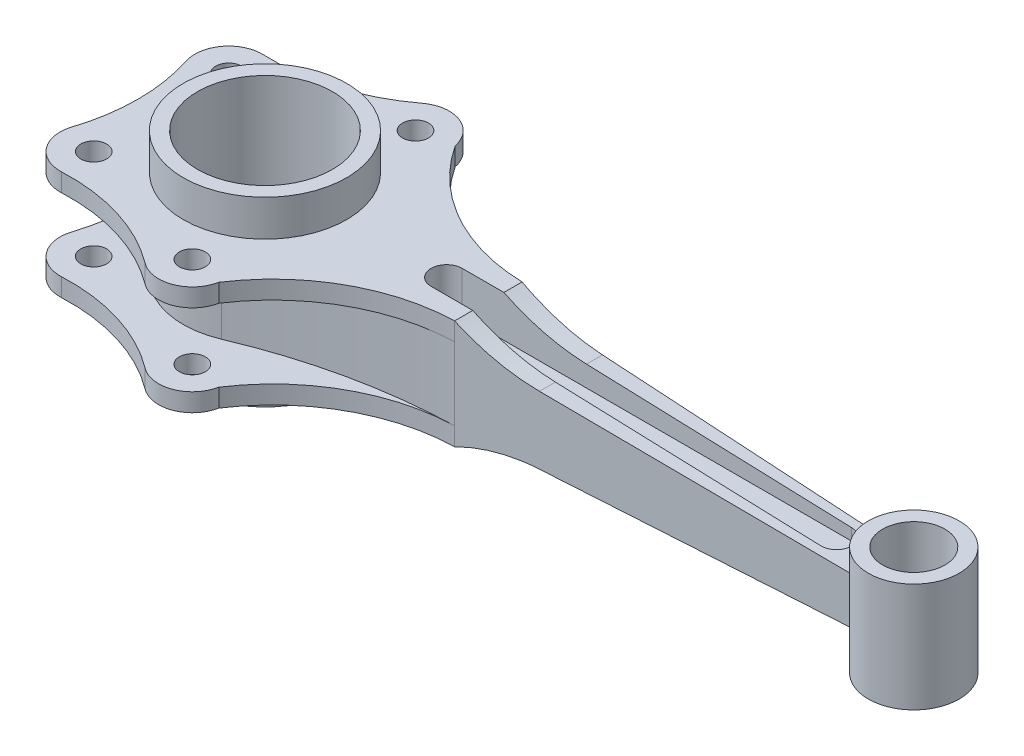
ISO-10303-21;
HEADER;
FILE_DESCRIPTION(('STEP AP214'),'2;1');
FILE_NAME('part.step','',(''),(''),'','','');
FILE_SCHEMA(('AUTOMOTIVE_DESIGN { 1 0 10303 214 1 1 1 1 }'));
ENDSEC;
DATA;
#1=APPLICATION_CONTEXT('core data for automotive mechanical design processes');
#2=APPLICATION_PROTOCOL_DEFINITION('international standard','automotive_design',2000,#1);
#3=PRODUCT_CONTEXT('',#1,'mechanical');
#4=PRODUCT('Part','Part','',(#3));
#5=PRODUCT_RELATED_PRODUCT_CATEGORY('part','',(#4));
#6=PRODUCT_DEFINITION_FORMATION('','',#4);
#7=PRODUCT_DEFINITION_CONTEXT('part definition',#1,'design');
#8=PRODUCT_DEFINITION('design','',#6,#7);
#9=PRODUCT_DEFINITION_SHAPE('','',#8);
#10=(LENGTH_UNIT() NAMED_UNIT(*) SI_UNIT(.MILLI.,.METRE.));
#11=(NAMED_UNIT(*) PLANE_ANGLE_UNIT() SI_UNIT($,.RADIAN.));
#12=(NAMED_UNIT(*) SI_UNIT($,.STERADIAN.) SOLID_ANGLE_UNIT());
#13=UNCERTAINTY_MEASURE_WITH_UNIT(LENGTH_MEASURE(1.E-05),#10,'distance_accuracy_value','');
#14=(GEOMETRIC_REPRESENTATION_CONTEXT(3) GLOBAL_UNCERTAINTY_ASSIGNED_CONTEXT((#13)) GLOBAL_UNIT_ASSIGNED_CONTEXT((#10,
#11,#12)) REPRESENTATION_CONTEXT('',''));
#15=CARTESIAN_POINT('',(0.,0.,0.));
#16=DIRECTION('',(0.,0.,1.));
#17=DIRECTION('',(1.,0.,0.));
#18=AXIS2_PLACEMENT_3D('',#15,#16,#17);
#19=CARTESIAN_POINT('',(88.,21.,-85.));
#20=DIRECTION('',(0.,-1.,0.));
#21=DIRECTION('',(0.,0.,-1.));
#22=AXIS2_PLACEMENT_3D('',#19,#20,#21);
#23=CYLINDRICAL_SURFACE('',#22,72.0259660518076);
#24=DIRECTION('',(0.,-1.,0.));
#25=VECTOR('',#24,1.);
#26=CARTESIAN_POINT('',(27.7513246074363,21.,-45.5305574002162));
#27=LINE('',#26,#25);
#28=CARTESIAN_POINT('',(27.7513246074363,-14.,-45.5305574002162));
#29=VERTEX_POINT('',#28);
#30=CARTESIAN_POINT('',(27.7513246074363,-21.,-45.5305574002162));
#31=VERTEX_POINT('',#30);
#32=EDGE_CURVE('E305',#29,#31,#27,.T.);
#33=ORIENTED_EDGE('',*,*,#32,.F.);
#34=CARTESIAN_POINT('',(88.,-14.,-85.));
#35=DIRECTION('',(0.,1.,0.));
#36=DIRECTION('',(1.,0.,0.));
#37=AXIS2_PLACEMENT_3D('',#34,#35,#36);
#38=CIRCLE('',#37,72.0259660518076);
#39=CARTESIAN_POINT('',(86.0661474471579,-14.,-13.));
#40=VERTEX_POINT('',#39);
#41=EDGE_CURVE('E296',#29,#40,#38,.T.);
#42=ORIENTED_EDGE('',*,*,#41,.T.);
#43=DIRECTION('',(0.,-1.,0.));
#44=VECTOR('',#43,1.);
#45=CARTESIAN_POINT('',(86.0661474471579,21.,-13.));
#46=LINE('',#45,#44);
#47=CARTESIAN_POINT('',(86.0661474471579,-21.,-13.));
#48=VERTEX_POINT('',#47);
#49=EDGE_CURVE('E303',#40,#48,#46,.T.);
#50=ORIENTED_EDGE('',*,*,#49,.T.);
#51=CARTESIAN_POINT('',(88.,-21.,-85.));
#52=DIRECTION('',(0.,1.,0.));
#53=DIRECTION('',(0.,0.,1.));
#54=AXIS2_PLACEMENT_3D('',#51,#52,#53);
#55=CIRCLE('',#54,72.0259660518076);
#56=EDGE_CURVE('E561',#31,#48,#55,.T.);
#57=ORIENTED_EDGE('',*,*,#56,.F.);
#58=EDGE_LOOP('',(#33,#42,#50,#57));
#59=FACE_BOUND('',#58,.T.);
#60=ADVANCED_FACE('F31',(#59),#23,.F.);
#61=CARTESIAN_POINT('',(15.,21.,-43.));
#62=DIRECTION('',(0.,-1.,0.));
#63=DIRECTION('',(0.,0.,-1.));
#64=AXIS2_PLACEMENT_3D('',#61,#62,#63);
#65=CYLINDRICAL_SURFACE('',#64,13.);
#66=CARTESIAN_POINT('',(15.,-14.,-43.));
#67=DIRECTION('',(0.,1.,0.));
#68=DIRECTION('',(1.,0.,0.));
#69=AXIS2_PLACEMENT_3D('',#66,#67,#68);
#70=CIRCLE('',#69,13.);
#71=CARTESIAN_POINT('',(7.18194667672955,-14.,-53.3864354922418));
#72=VERTEX_POINT('',#71);
#73=EDGE_CURVE('E306',#29,#72,#70,.T.);
#74=ORIENTED_EDGE('',*,*,#73,.F.);
#75=ORIENTED_EDGE('',*,*,#32,.T.);
#76=CARTESIAN_POINT('',(15.,-21.,-43.));
#77=DIRECTION('',(0.,1.,0.));
#78=DIRECTION('',(0.,0.,1.));
#79=AXIS2_PLACEMENT_3D('',#76,#77,#78);
#80=CIRCLE('',#79,13.);
#81=CARTESIAN_POINT('',(7.18194667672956,-21.,-53.3864354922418));
#82=VERTEX_POINT('',#81);
#83=EDGE_CURVE('E592',#31,#82,#80,.T.);
#84=ORIENTED_EDGE('',*,*,#83,.T.);
#85=DIRECTION('',(0.,-1.,0.));
#86=VECTOR('',#85,1.);
#87=CARTESIAN_POINT('',(7.18194667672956,21.,-53.3864354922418));
#88=LINE('',#87,#86);
#89=EDGE_CURVE('E643',#72,#82,#88,.T.);
#90=ORIENTED_EDGE('',*,*,#89,.F.);
#91=EDGE_LOOP('',(#74,#75,#84,#90));
#92=FACE_BOUND('',#91,.T.);
#93=ADVANCED_FACE('F656',(#92),#65,.T.);
#94=CARTESIAN_POINT('',(-36.1180409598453,21.,-110.911308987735));
#95=DIRECTION('',(0.,-1.,0.));
#96=DIRECTION('',(0.,0.,-1.));
#97=AXIS2_PLACEMENT_3D('',#94,#95,#96);
#98=CYLINDRICAL_SURFACE('',#97,72.);
#99=DIRECTION('',(0.,-1.,0.));
#100=VECTOR('',#99,1.);
#101=CARTESIAN_POINT('',(-39.4062886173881,21.,-38.9864354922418));
#102=LINE('',#101,#100);
#103=CARTESIAN_POINT('',(-39.4062886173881,-14.,-38.9864354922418));
#104=VERTEX_POINT('',#103);
#105=CARTESIAN_POINT('',(-39.4062886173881,-21.,-38.9864354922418));
#106=VERTEX_POINT('',#105);
#107=EDGE_CURVE('E640',#104,#106,#102,.T.);
#108=ORIENTED_EDGE('',*,*,#107,.F.);
#109=CARTESIAN_POINT('',(-36.1180409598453,-14.,-110.911308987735));
#110=DIRECTION('',(0.,1.,0.));
#111=DIRECTION('',(1.,0.,0.));
#112=AXIS2_PLACEMENT_3D('',#109,#110,#111);
#113=CIRCLE('',#112,72.);
#114=EDGE_CURVE('E374',#104,#72,#113,.T.);
#115=ORIENTED_EDGE('',*,*,#114,.T.);
#116=ORIENTED_EDGE('',*,*,#89,.T.);
#117=CARTESIAN_POINT('',(-36.1180409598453,-21.,-110.911308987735));
#118=DIRECTION('',(0.,1.,0.));
#119=DIRECTION('',(0.,0.,1.));
#120=AXIS2_PLACEMENT_3D('',#117,#118,#119);
#121=CIRCLE('',#120,72.);
#122=EDGE_CURVE('E595',#106,#82,#121,.T.);
#123=ORIENTED_EDGE('',*,*,#122,.F.);
#124=EDGE_LOOP('',(#108,#115,#116,#123));
#125=FACE_BOUND('',#124,.T.);
#126=ADVANCED_FACE('F653',(#125),#98,.F.);
#127=CARTESIAN_POINT('',(-40.,21.,-26.));
#128=DIRECTION('',(0.,-1.,0.));
#129=DIRECTION('',(0.,0.,-1.));
#130=AXIS2_PLACEMENT_3D('',#127,#128,#129);
#131=CYLINDRICAL_SURFACE('',#130,13.);
#132=CARTESIAN_POINT('',(-40.,-14.,-26.));
#133=DIRECTION('',(0.,1.,0.));
#134=DIRECTION('',(1.,0.,0.));
#135=AXIS2_PLACEMENT_3D('',#132,#133,#134);
#136=CIRCLE('',#135,13.);
#137=CARTESIAN_POINT('',(-52.3769011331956,-14.,-22.0235294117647));
#138=VERTEX_POINT('',#137);
#139=EDGE_CURVE('E377',#104,#138,#136,.T.);
#140=ORIENTED_EDGE('',*,*,#139,.F.);
#141=ORIENTED_EDGE('',*,*,#107,.T.);
#142=CARTESIAN_POINT('',(-40.,-21.,-26.));
#143=DIRECTION('',(0.,1.,0.));
#144=DIRECTION('',(0.,0.,1.));
#145=AXIS2_PLACEMENT_3D('',#142,#143,#144);
#146=CIRCLE('',#145,13.);
#147=CARTESIAN_POINT('',(-52.3769011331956,-21.,-22.0235294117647));
#148=VERTEX_POINT('',#147);
#149=EDGE_CURVE('E598',#106,#148,#146,.T.);
#150=ORIENTED_EDGE('',*,*,#149,.T.);
#151=DIRECTION('',(0.,-1.,0.));
#152=VECTOR('',#151,1.);
#153=CARTESIAN_POINT('',(-52.3769011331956,21.,-22.0235294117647));
#154=LINE('',#153,#152);
#155=EDGE_CURVE('E636',#138,#148,#154,.T.);
#156=ORIENTED_EDGE('',*,*,#155,.F.);
#157=EDGE_LOOP('',(#140,#141,#150,#156));
#158=FACE_BOUND('',#157,.T.);
#159=ADVANCED_FACE('F665',(#158),#131,.T.);
#160=CARTESIAN_POINT('',(-120.925892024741,21.,0.));
#161=DIRECTION('',(0.,-1.,0.));
#162=DIRECTION('',(0.,0.,-1.));
#163=AXIS2_PLACEMENT_3D('',#160,#161,#162);
#164=CYLINDRICAL_SURFACE('',#163,72.);
#165=DIRECTION('',(0.,-1.,0.));
#166=VECTOR('',#165,1.);
#167=CARTESIAN_POINT('',(-52.3769011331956,21.,22.0235294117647));
#168=LINE('',#167,#166);
#169=CARTESIAN_POINT('',(-52.3769011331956,-14.,22.0235294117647));
#170=VERTEX_POINT('',#169);
#171=CARTESIAN_POINT('',(-52.3769011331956,-21.,22.0235294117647));
#172=VERTEX_POINT('',#171);
#173=EDGE_CURVE('E632',#170,#172,#168,.T.);
#174=ORIENTED_EDGE('',*,*,#173,.F.);
#175=CARTESIAN_POINT('',(-120.925892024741,-14.,0.));
#176=DIRECTION('',(0.,1.,0.));
#177=DIRECTION('',(1.,0.,0.));
#178=AXIS2_PLACEMENT_3D('',#175,#176,#177);
#179=CIRCLE('',#178,72.);
#180=EDGE_CURVE('E379',#170,#138,#179,.T.);
#181=ORIENTED_EDGE('',*,*,#180,.T.);
#182=ORIENTED_EDGE('',*,*,#155,.T.);
#183=CARTESIAN_POINT('',(-120.925892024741,-21.,0.));
#184=DIRECTION('',(0.,1.,0.));
#185=DIRECTION('',(0.,0.,1.));
#186=AXIS2_PLACEMENT_3D('',#183,#184,#185);
#187=CIRCLE('',#186,72.);
#188=EDGE_CURVE('E601',#172,#148,#187,.T.);
#189=ORIENTED_EDGE('',*,*,#188,.F.);
#190=EDGE_LOOP('',(#174,#181,#182,#189));
#191=FACE_BOUND('',#190,.T.);
#192=ADVANCED_FACE('F669',(#191),#164,.F.);
#193=CARTESIAN_POINT('',(-40.,21.,26.));
#194=DIRECTION('',(0.,-1.,0.));
#195=DIRECTION('',(0.,0.,-1.));
#196=AXIS2_PLACEMENT_3D('',#193,#194,#195);
#197=CYLINDRICAL_SURFACE('',#196,13.);
#198=DIRECTION('',(0.,-1.,0.));
#199=VECTOR('',#198,1.);
#200=CARTESIAN_POINT('',(-39.4062886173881,21.,38.9864354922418));
#201=LINE('',#200,#199);
#202=CARTESIAN_POINT('',(-39.4062886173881,-14.,38.9864354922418));
#203=VERTEX_POINT('',#202);
#204=CARTESIAN_POINT('',(-39.4062886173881,-21.,38.9864354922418));
#205=VERTEX_POINT('',#204);
#206=EDGE_CURVE('E628',#203,#205,#201,.T.);
#207=ORIENTED_EDGE('',*,*,#206,.F.);
#208=CARTESIAN_POINT('',(-40.,-14.,26.));
#209=DIRECTION('',(0.,1.,0.));
#210=DIRECTION('',(1.,0.,0.));
#211=AXIS2_PLACEMENT_3D('',#208,#209,#210);
#212=CIRCLE('',#211,13.);
#213=EDGE_CURVE('E382',#170,#203,#212,.T.);
#214=ORIENTED_EDGE('',*,*,#213,.F.);
#215=ORIENTED_EDGE('',*,*,#173,.T.);
#216=CARTESIAN_POINT('',(-40.,-21.,26.));
#217=DIRECTION('',(0.,1.,0.));
#218=DIRECTION('',(0.,0.,1.));
#219=AXIS2_PLACEMENT_3D('',#216,#217,#218);
#220=CIRCLE('',#219,13.);
#221=EDGE_CURVE('E604',#205,#172,#220,.F.);
#222=ORIENTED_EDGE('',*,*,#221,.F.);
#223=EDGE_LOOP('',(#207,#214,#215,#222));
#224=FACE_BOUND('',#223,.T.);
#225=ADVANCED_FACE('F673',(#224),#197,.T.);
#226=CARTESIAN_POINT('',(-36.1180409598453,21.,110.911308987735));
#227=DIRECTION('',(0.,-1.,0.));
#228=DIRECTION('',(0.,0.,-1.));
#229=AXIS2_PLACEMENT_3D('',#226,#227,#228);
#230=CYLINDRICAL_SURFACE('',#229,72.);
#231=CARTESIAN_POINT('',(-36.1180409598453,-14.,110.911308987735));
#232=DIRECTION('',(0.,1.,0.));
#233=DIRECTION('',(1.,0.,0.));
#234=AXIS2_PLACEMENT_3D('',#231,#232,#233);
#235=CIRCLE('',#234,72.);
#236=CARTESIAN_POINT('',(7.18194667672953,-14.,53.3864354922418));
#237=VERTEX_POINT('',#236);
#238=EDGE_CURVE('E384',#237,#203,#235,.T.);
#239=ORIENTED_EDGE('',*,*,#238,.T.);
#240=ORIENTED_EDGE('',*,*,#206,.T.);
#241=CARTESIAN_POINT('',(-36.1180409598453,-21.,110.911308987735));
#242=DIRECTION('',(0.,1.,0.));
#243=DIRECTION('',(0.,0.,1.));
#244=AXIS2_PLACEMENT_3D('',#241,#242,#243);
#245=CIRCLE('',#244,72.);
#246=CARTESIAN_POINT('',(7.18194667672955,-21.,53.3864354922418));
#247=VERTEX_POINT('',#246);
#248=EDGE_CURVE('E607',#205,#247,#245,.F.);
#249=ORIENTED_EDGE('',*,*,#248,.T.);
#250=DIRECTION('',(0.,-1.,0.));
#251=VECTOR('',#250,1.);
#252=CARTESIAN_POINT('',(7.18194667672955,21.,53.3864354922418));
#253=LINE('',#252,#251);
#254=EDGE_CURVE('E624',#237,#247,#253,.T.);
#255=ORIENTED_EDGE('',*,*,#254,.F.);
#256=EDGE_LOOP('',(#239,#240,#249,#255));
#257=FACE_BOUND('',#256,.T.);
#258=ADVANCED_FACE('F677',(#257),#230,.F.);
#259=CARTESIAN_POINT('',(15.,21.,43.));
#260=DIRECTION('',(0.,-1.,0.));
#261=DIRECTION('',(0.,0.,-1.));
#262=AXIS2_PLACEMENT_3D('',#259,#260,#261);
#263=CYLINDRICAL_SURFACE('',#262,13.);
#264=DIRECTION('',(0.,-1.,0.));
#265=VECTOR('',#264,1.);
#266=CARTESIAN_POINT('',(27.7513246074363,21.,45.5305574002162));
#267=LINE('',#266,#265);
#268=CARTESIAN_POINT('',(27.7513246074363,-14.,45.5305574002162));
#269=VERTEX_POINT('',#268);
#270=CARTESIAN_POINT('',(27.7513246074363,-21.,45.5305574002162));
#271=VERTEX_POINT('',#270);
#272=EDGE_CURVE('E620',#269,#271,#267,.T.);
#273=ORIENTED_EDGE('',*,*,#272,.F.);
#274=CARTESIAN_POINT('',(15.,-14.,43.));
#275=DIRECTION('',(0.,1.,0.));
#276=DIRECTION('',(1.,0.,0.));
#277=AXIS2_PLACEMENT_3D('',#274,#275,#276);
#278=CIRCLE('',#277,13.);
#279=EDGE_CURVE('E387',#237,#269,#278,.T.);
#280=ORIENTED_EDGE('',*,*,#279,.F.);
#281=ORIENTED_EDGE('',*,*,#254,.T.);
#282=CARTESIAN_POINT('',(15.,-21.,43.));
#283=DIRECTION('',(0.,1.,0.));
#284=DIRECTION('',(0.,0.,1.));
#285=AXIS2_PLACEMENT_3D('',#282,#283,#284);
#286=CIRCLE('',#285,13.);
#287=EDGE_CURVE('E610',#271,#247,#286,.F.);
#288=ORIENTED_EDGE('',*,*,#287,.F.);
#289=EDGE_LOOP('',(#273,#280,#281,#288));
#290=FACE_BOUND('',#289,.T.);
#291=ADVANCED_FACE('F682',(#290),#263,.T.);
#292=CARTESIAN_POINT('',(88.,21.,85.));
#293=DIRECTION('',(0.,-1.,0.));
#294=DIRECTION('',(0.,0.,-1.));
#295=AXIS2_PLACEMENT_3D('',#292,#293,#294);
#296=CYLINDRICAL_SURFACE('',#295,72.0259660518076);
#297=CARTESIAN_POINT('',(88.,-14.,85.));
#298=DIRECTION('',(0.,1.,0.));
#299=DIRECTION('',(1.,0.,0.));
#300=AXIS2_PLACEMENT_3D('',#297,#298,#299);
#301=CIRCLE('',#300,72.0259660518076);
#302=CARTESIAN_POINT('',(86.0661474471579,-14.,13.));
#303=VERTEX_POINT('',#302);
#304=EDGE_CURVE('E48',#303,#269,#301,.T.);
#305=ORIENTED_EDGE('',*,*,#304,.T.);
#306=ORIENTED_EDGE('',*,*,#272,.T.);
#307=CARTESIAN_POINT('',(88.,-21.,85.));
#308=DIRECTION('',(0.,1.,0.));
#309=DIRECTION('',(0.,0.,1.));
#310=AXIS2_PLACEMENT_3D('',#307,#308,#309);
#311=CIRCLE('',#310,72.0259660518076);
#312=CARTESIAN_POINT('',(86.0661474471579,-21.,13.));
#313=VERTEX_POINT('',#312);
#314=EDGE_CURVE('E566',#271,#313,#311,.F.);
#315=ORIENTED_EDGE('',*,*,#314,.T.);
#316=DIRECTION('',(0.,-1.,0.));
#317=VECTOR('',#316,1.);
#318=CARTESIAN_POINT('',(86.0661474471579,21.,13.));
#319=LINE('',#318,#317);
#320=EDGE_CURVE('E616',#303,#313,#319,.T.);
#321=ORIENTED_EDGE('',*,*,#320,.F.);
#322=EDGE_LOOP('',(#305,#306,#315,#321));
#323=FACE_BOUND('',#322,.T.);
#324=ADVANCED_FACE('F685',(#323),#296,.F.);
#325=CARTESIAN_POINT('',(120.567808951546,-90.9545234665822,-24.));
#326=DIRECTION('',(0.,0.,1.));
#327=DIRECTION('',(1.,0.,0.));
#328=AXIS2_PLACEMENT_3D('',#325,#326,#327);
#329=CYLINDRICAL_SURFACE('',#328,78.);
#330=DIRECTION('',(0.,0.,1.));
#331=VECTOR('',#330,1.);
#332=CARTESIAN_POINT('',(117.904677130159,-13.,-24.));
#333=LINE('',#332,#331);
#334=CARTESIAN_POINT('',(117.904677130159,-13.,-12.1448469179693));
#335=VERTEX_POINT('',#334);
#336=CARTESIAN_POINT('',(117.904677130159,-13.,-6.00000000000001));
#337=VERTEX_POINT('',#336);
#338=EDGE_CURVE('E519',#335,#337,#333,.T.);
#339=ORIENTED_EDGE('',*,*,#338,.T.);
#340=CARTESIAN_POINT('',(120.567808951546,-90.9545234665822,-6.00000000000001));
#341=DIRECTION('',(0.,0.,-1.));
#342=DIRECTION('',(-1.,0.,0.));
#343=AXIS2_PLACEMENT_3D('',#340,#341,#342);
#344=CIRCLE('',#343,78.);
#345=CARTESIAN_POINT('',(86.0661474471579,-21.,-6.00000000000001));
#346=VERTEX_POINT('',#345);
#347=EDGE_CURVE('E421',#346,#337,#344,.T.);
#348=ORIENTED_EDGE('',*,*,#347,.F.);
#349=DIRECTION('',(0.,0.,1.));
#350=VECTOR('',#349,1.);
#351=CARTESIAN_POINT('',(86.0661474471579,-21.,-24.));
#352=LINE('',#351,#350);
#353=EDGE_CURVE('E40',#48,#346,#352,.T.);
#354=ORIENTED_EDGE('',*,*,#353,.F.);
#355=CARTESIAN_POINT('',(120.567808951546,-90.9545234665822,-12.0733176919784));
#356=DIRECTION('',(0.0268493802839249,0.,-0.999639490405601));
#357=DIRECTION('',(0.999639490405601,0.,0.0268493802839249));
#358=AXIS2_PLACEMENT_3D('',#355,#356,#357);
#359=ELLIPSE('',#358,78.0281298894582,78.);
#360=EDGE_CURVE('E310',#48,#335,#359,.T.);
#361=ORIENTED_EDGE('',*,*,#360,.T.);
#362=EDGE_LOOP('',(#339,#348,#354,#361));
#363=FACE_BOUND('',#362,.T.);
#364=ADVANCED_FACE('F772',(#363),#329,.F.);
#365=CARTESIAN_POINT('',(-169.44429381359,21.,-1.67309344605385));
#366=DIRECTION('',(0.,1.,0.));
#367=DIRECTION('',(0.,0.,1.));
#368=AXIS2_PLACEMENT_3D('',#365,#366,#367);
#369=PLANE('',#368);
#370=CARTESIAN_POINT('',(15.,21.,-43.));
#371=DIRECTION('',(0.,1.,0.));
#372=DIRECTION('',(0.,0.,1.));
#373=AXIS2_PLACEMENT_3D('',#370,#371,#372);
#374=CIRCLE('',#373,5.);
#375=CARTESIAN_POINT('',(15.,21.,-38.));
#376=VERTEX_POINT('',#375);
#377=EDGE_CURVE('E1296',#376,#376,#374,.T.);
#378=ORIENTED_EDGE('',*,*,#377,.F.);
#379=EDGE_LOOP('',(#378));
#380=FACE_BOUND('',#379,.T.);
#381=CARTESIAN_POINT('',(-40.,21.,-26.));
#382=DIRECTION('',(0.,1.,0.));
#383=DIRECTION('',(0.,0.,1.));
#384=AXIS2_PLACEMENT_3D('',#381,#382,#383);
#385=CIRCLE('',#384,5.);
#386=CARTESIAN_POINT('',(-40.,21.,-21.));
#387=VERTEX_POINT('',#386);
#388=EDGE_CURVE('E351',#387,#387,#385,.T.);
#389=ORIENTED_EDGE('',*,*,#388,.F.);
#390=EDGE_LOOP('',(#389));
#391=FACE_BOUND('',#390,.T.);
#392=CARTESIAN_POINT('',(-40.,21.,26.));
#393=DIRECTION('',(0.,1.,0.));
#394=DIRECTION('',(0.,0.,1.));
#395=AXIS2_PLACEMENT_3D('',#392,#393,#394);
#396=CIRCLE('',#395,5.);
#397=CARTESIAN_POINT('',(-40.,21.,31.));
#398=VERTEX_POINT('',#397);
#399=EDGE_CURVE('E348',#398,#398,#396,.T.);
#400=ORIENTED_EDGE('',*,*,#399,.F.);
#401=EDGE_LOOP('',(#400));
#402=FACE_BOUND('',#401,.T.);
#403=CARTESIAN_POINT('',(15.,21.,43.));
#404=DIRECTION('',(0.,1.,0.));
#405=DIRECTION('',(0.,0.,1.));
#406=AXIS2_PLACEMENT_3D('',#403,#404,#405);
#407=CIRCLE('',#406,5.);
#408=CARTESIAN_POINT('',(15.,21.,48.));
#409=VERTEX_POINT('',#408);
#410=EDGE_CURVE('E366',#409,#409,#407,.T.);
#411=ORIENTED_EDGE('',*,*,#410,.F.);
#412=EDGE_LOOP('',(#411));
#413=FACE_BOUND('',#412,.T.);
#414=CARTESIAN_POINT('',(0.,21.,0.));
#415=DIRECTION('',(0.,1.,0.));
#416=DIRECTION('',(0.,0.,1.));
#417=AXIS2_PLACEMENT_3D('',#414,#415,#416);
#418=CIRCLE('',#417,31.5);
#419=CARTESIAN_POINT('',(0.,21.,31.5));
#420=VERTEX_POINT('',#419);
#421=EDGE_CURVE('E587',#420,#420,#418,.T.);
#422=ORIENTED_EDGE('',*,*,#421,.F.);
#423=EDGE_LOOP('',(#422));
#424=FACE_BOUND('',#423,.T.);
#425=DIRECTION('',(0.,0.,1.));
#426=VECTOR('',#425,1.);
#427=CARTESIAN_POINT('',(86.0661474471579,21.,-24.));
#428=LINE('',#427,#426);
#429=CARTESIAN_POINT('',(86.0661474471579,21.,6.00000000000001));
#430=VERTEX_POINT('',#429);
#431=CARTESIAN_POINT('',(86.0661474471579,21.,13.));
#432=VERTEX_POINT('',#431);
#433=EDGE_CURVE('E322',#430,#432,#428,.T.);
#434=ORIENTED_EDGE('',*,*,#433,.F.);
#435=DIRECTION('',(1.,0.,0.));
#436=VECTOR('',#435,1.);
#437=CARTESIAN_POINT('',(70.,21.,6.00000000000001));
#438=LINE('',#437,#436);
#439=CARTESIAN_POINT('',(70.,21.,6.00000000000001));
#440=VERTEX_POINT('',#439);
#441=EDGE_CURVE('E476',#440,#430,#438,.T.);
#442=ORIENTED_EDGE('',*,*,#441,.F.);
#443=CARTESIAN_POINT('',(70.,21.,0.));
#444=DIRECTION('',(0.,1.,0.));
#445=DIRECTION('',(0.,0.,1.));
#446=AXIS2_PLACEMENT_3D('',#443,#444,#445);
#447=CIRCLE('',#446,6.00000000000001);
#448=CARTESIAN_POINT('',(70.,21.,-6.00000000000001));
#449=VERTEX_POINT('',#448);
#450=EDGE_CURVE('E474',#449,#440,#447,.T.);
#451=ORIENTED_EDGE('',*,*,#450,.F.);
#452=DIRECTION('',(-1.,0.,0.));
#453=VECTOR('',#452,1.);
#454=CARTESIAN_POINT('',(70.,21.,-6.00000000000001));
#455=LINE('',#454,#453);
#456=CARTESIAN_POINT('',(86.0661474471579,21.,-6.00000000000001));
#457=VERTEX_POINT('',#456);
#458=EDGE_CURVE('E504',#457,#449,#455,.T.);
#459=ORIENTED_EDGE('',*,*,#458,.F.);
#460=CARTESIAN_POINT('',(86.0661474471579,21.,-13.));
#461=VERTEX_POINT('',#460);
#462=EDGE_CURVE('E323',#461,#457,#428,.T.);
#463=ORIENTED_EDGE('',*,*,#462,.F.);
#464=CARTESIAN_POINT('',(88.,21.,-85.));
#465=DIRECTION('',(0.,1.,0.));
#466=DIRECTION('',(0.,0.,1.));
#467=AXIS2_PLACEMENT_3D('',#464,#465,#466);
#468=CIRCLE('',#467,72.0259660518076);
#469=CARTESIAN_POINT('',(27.7513246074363,21.,-45.5305574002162));
#470=VERTEX_POINT('',#469);
#471=EDGE_CURVE('E562',#470,#461,#468,.T.);
#472=ORIENTED_EDGE('',*,*,#471,.F.);
#473=CARTESIAN_POINT('',(15.,21.,-43.));
#474=DIRECTION('',(0.,1.,0.));
#475=DIRECTION('',(0.,0.,1.));
#476=AXIS2_PLACEMENT_3D('',#473,#474,#475);
#477=CIRCLE('',#476,13.);
#478=CARTESIAN_POINT('',(7.18194667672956,21.,-53.3864354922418));
#479=VERTEX_POINT('',#478);
#480=EDGE_CURVE('E565',#470,#479,#477,.T.);
#481=ORIENTED_EDGE('',*,*,#480,.T.);
#482=CARTESIAN_POINT('',(-36.1180409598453,21.,-110.911308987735));
#483=DIRECTION('',(0.,1.,0.));
#484=DIRECTION('',(0.,0.,1.));
#485=AXIS2_PLACEMENT_3D('',#482,#483,#484);
#486=CIRCLE('',#485,72.);
#487=CARTESIAN_POINT('',(-39.4062886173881,21.,-38.9864354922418));
#488=VERTEX_POINT('',#487);
#489=EDGE_CURVE('E568',#488,#479,#486,.T.);
#490=ORIENTED_EDGE('',*,*,#489,.F.);
#491=CARTESIAN_POINT('',(-40.,21.,-26.));
#492=DIRECTION('',(0.,1.,0.));
#493=DIRECTION('',(0.,0.,1.));
#494=AXIS2_PLACEMENT_3D('',#491,#492,#493);
#495=CIRCLE('',#494,13.);
#496=CARTESIAN_POINT('',(-52.3769011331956,21.,-22.0235294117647));
#497=VERTEX_POINT('',#496);
#498=EDGE_CURVE('E571',#488,#497,#495,.T.);
#499=ORIENTED_EDGE('',*,*,#498,.T.);
#500=CARTESIAN_POINT('',(-120.925892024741,21.,0.));
#501=DIRECTION('',(0.,1.,0.));
#502=DIRECTION('',(0.,0.,1.));
#503=AXIS2_PLACEMENT_3D('',#500,#501,#502);
#504=CIRCLE('',#503,72.);
#505=CARTESIAN_POINT('',(-52.3769011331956,21.,22.0235294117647));
#506=VERTEX_POINT('',#505);
#507=EDGE_CURVE('E573',#506,#497,#504,.T.);
#508=ORIENTED_EDGE('',*,*,#507,.F.);
#509=CARTESIAN_POINT('',(-40.,21.,26.));
#510=DIRECTION('',(0.,1.,0.));
#511=DIRECTION('',(0.,0.,1.));
#512=AXIS2_PLACEMENT_3D('',#509,#510,#511);
#513=CIRCLE('',#512,13.);
#514=CARTESIAN_POINT('',(-39.4062886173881,21.,38.9864354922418));
#515=VERTEX_POINT('',#514);
#516=EDGE_CURVE('E576',#515,#506,#513,.F.);
#517=ORIENTED_EDGE('',*,*,#516,.F.);
#518=CARTESIAN_POINT('',(-36.1180409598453,21.,110.911308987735));
#519=DIRECTION('',(0.,1.,0.));
#520=DIRECTION('',(0.,0.,1.));
#521=AXIS2_PLACEMENT_3D('',#518,#519,#520);
#522=CIRCLE('',#521,72.);
#523=CARTESIAN_POINT('',(7.18194667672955,21.,53.3864354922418));
#524=VERTEX_POINT('',#523);
#525=EDGE_CURVE('E579',#515,#524,#522,.F.);
#526=ORIENTED_EDGE('',*,*,#525,.T.);
#527=CARTESIAN_POINT('',(15.,21.,43.));
#528=DIRECTION('',(0.,1.,0.));
#529=DIRECTION('',(0.,0.,1.));
#530=AXIS2_PLACEMENT_3D('',#527,#528,#529);
#531=CIRCLE('',#530,13.);
#532=CARTESIAN_POINT('',(27.7513246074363,21.,45.5305574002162));
#533=VERTEX_POINT('',#532);
#534=EDGE_CURVE('E581',#533,#524,#531,.F.);
#535=ORIENTED_EDGE('',*,*,#534,.F.);
#536=CARTESIAN_POINT('',(88.,21.,85.));
#537=DIRECTION('',(0.,1.,0.));
#538=DIRECTION('',(0.,0.,1.));
#539=AXIS2_PLACEMENT_3D('',#536,#537,#538);
#540=CIRCLE('',#539,72.0259660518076);
#541=EDGE_CURVE('E584',#533,#432,#540,.F.);
#542=ORIENTED_EDGE('',*,*,#541,.T.);
#543=EDGE_LOOP('',(#434,#442,#451,#459,#463,#472,#481,#490,#499,#508,#517,#526,#535,#542));
#544=FACE_BOUND('',#543,.T.);
#545=ADVANCED_FACE('F719',(#380,#391,#402,#413,#424,#544),#369,.T.);
#546=CARTESIAN_POINT('',(117.904677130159,13.,-24.));
#547=DIRECTION('',(-0.0341427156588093,-0.999416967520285,0.));
#548=DIRECTION('',(0.999416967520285,-0.0341427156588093,0.));
#549=AXIS2_PLACEMENT_3D('',#546,#547,#548);
#550=PLANE('',#549);
#551=DIRECTION('',(-0.999416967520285,0.0341427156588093,0.));
#552=VECTOR('',#551,1.);
#553=CARTESIAN_POINT('',(69.3051077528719,14.6602892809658,6.00000000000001));
#554=LINE('',#553,#552);
#555=CARTESIAN_POINT('',(220.,9.51215489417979,6.00000000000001));
#556=VERTEX_POINT('',#555);
#557=CARTESIAN_POINT('',(117.904677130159,13.,6.00000000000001));
#558=VERTEX_POINT('',#557);
#559=EDGE_CURVE('E471',#556,#558,#554,.T.);
#560=ORIENTED_EDGE('',*,*,#559,.T.);
#561=DIRECTION('',(0.,0.,1.));
#562=VECTOR('',#561,1.);
#563=CARTESIAN_POINT('',(117.904677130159,13.,-24.));
#564=LINE('',#563,#562);
#565=CARTESIAN_POINT('',(117.904677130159,13.,12.1448469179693));
#566=VERTEX_POINT('',#565);
#567=EDGE_CURVE('E532',#558,#566,#564,.T.);
#568=ORIENTED_EDGE('',*,*,#567,.T.);
#569=DIRECTION('',(-0.99905708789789,0.0341304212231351,0.0268337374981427));
#570=VECTOR('',#569,1.);
#571=CARTESIAN_POINT('',(-168.805008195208,22.7947579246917,19.8456004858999));
#572=LINE('',#571,#570);
#573=CARTESIAN_POINT('',(234.991668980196,9.,9.));
#574=VERTEX_POINT('',#573);
#575=EDGE_CURVE('E326',#574,#566,#572,.T.);
#576=ORIENTED_EDGE('',*,*,#575,.F.);
#577=CARTESIAN_POINT('',(250.,8.48727588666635,0.));
#578=DIRECTION('',(-0.0341427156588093,-0.999416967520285,0.));
#579=DIRECTION('',(0.999416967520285,-0.0341427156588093,0.));
#580=AXIS2_PLACEMENT_3D('',#577,#578,#579);
#581=ELLIPSE('',#580,17.5102090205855,17.4999999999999);
#582=CARTESIAN_POINT('',(234.991668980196,9.,-8.99999999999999));
#583=VERTEX_POINT('',#582);
#584=EDGE_CURVE('E541',#574,#583,#581,.T.);
#585=ORIENTED_EDGE('',*,*,#584,.T.);
#586=DIRECTION('',(-0.99905708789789,0.0341304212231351,-0.0268337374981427));
#587=VECTOR('',#586,1.);
#588=CARTESIAN_POINT('',(-168.894714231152,22.797822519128,-19.8480099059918));
#589=LINE('',#588,#587);
#590=CARTESIAN_POINT('',(117.904677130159,13.,-12.1448469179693));
#591=VERTEX_POINT('',#590);
#592=EDGE_CURVE('E544',#583,#591,#589,.T.);
#593=ORIENTED_EDGE('',*,*,#592,.T.);
#594=CARTESIAN_POINT('',(117.904677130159,13.,-6.00000000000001));
#595=VERTEX_POINT('',#594);
#596=EDGE_CURVE('E533',#591,#595,#564,.T.);
#597=ORIENTED_EDGE('',*,*,#596,.T.);
#598=DIRECTION('',(0.999416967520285,-0.0341427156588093,0.));
#599=VECTOR('',#598,1.);
#600=CARTESIAN_POINT('',(69.3051077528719,14.6602892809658,-6.00000000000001));
#601=LINE('',#600,#599);
#602=CARTESIAN_POINT('',(220.,9.51215489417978,-6.00000000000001));
#603=VERTEX_POINT('',#602);
#604=EDGE_CURVE('E501',#595,#603,#601,.T.);
#605=ORIENTED_EDGE('',*,*,#604,.T.);
#606=CARTESIAN_POINT('',(220.,9.51215489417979,0.));
#607=DIRECTION('',(-0.0341427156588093,-0.999416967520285,0.));
#608=DIRECTION('',(0.999416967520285,-0.0341427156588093,0.));
#609=AXIS2_PLACEMENT_3D('',#606,#607,#608);
#610=ELLIPSE('',#609,6.00350023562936,6.00000000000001);
#611=EDGE_CURVE('E468',#603,#556,#610,.T.);
#612=ORIENTED_EDGE('',*,*,#611,.T.);
#613=EDGE_LOOP('',(#560,#568,#576,#585,#593,#597,#605,#612));
#614=FACE_BOUND('',#613,.T.);
#615=ADVANCED_FACE('F759',(#614),#550,.F.);
#616=CARTESIAN_POINT('',(120.567808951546,90.9545234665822,-24.));
#617=DIRECTION('',(0.,0.,1.));
#618=DIRECTION('',(1.,0.,0.));
#619=AXIS2_PLACEMENT_3D('',#616,#617,#618);
#620=CYLINDRICAL_SURFACE('',#619,78.);
#621=CARTESIAN_POINT('',(120.567808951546,90.9545234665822,6.00000000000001));
#622=DIRECTION('',(0.,0.,-1.));
#623=DIRECTION('',(-1.,0.,0.));
#624=AXIS2_PLACEMENT_3D('',#621,#622,#623);
#625=CIRCLE('',#624,78.);
#626=EDGE_CURVE('E465',#558,#430,#625,.T.);
#627=ORIENTED_EDGE('',*,*,#626,.T.);
#628=ORIENTED_EDGE('',*,*,#433,.T.);
#629=CARTESIAN_POINT('',(120.567808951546,90.9545234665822,12.0733176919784));
#630=DIRECTION('',(-0.0268493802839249,0.,-0.999639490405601));
#631=DIRECTION('',(-0.999639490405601,0.,0.0268493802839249));
#632=AXIS2_PLACEMENT_3D('',#629,#630,#631);
#633=ELLIPSE('',#632,78.0281298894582,78.);
#634=EDGE_CURVE('E536',#566,#432,#633,.T.);
#635=ORIENTED_EDGE('',*,*,#634,.F.);
#636=ORIENTED_EDGE('',*,*,#567,.F.);
#637=EDGE_LOOP('',(#627,#628,#635,#636));
#638=FACE_BOUND('',#637,.T.);
#639=ADVANCED_FACE('F853',(#638),#620,.F.);
#640=CARTESIAN_POINT('',(120.567808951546,90.9545234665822,-6.00000000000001));
#641=DIRECTION('',(0.,0.,1.));
#642=DIRECTION('',(1.,0.,0.));
#643=AXIS2_PLACEMENT_3D('',#640,#641,#642);
#644=CIRCLE('',#643,78.);
#645=EDGE_CURVE('E498',#457,#595,#644,.T.);
#646=ORIENTED_EDGE('',*,*,#645,.T.);
#647=ORIENTED_EDGE('',*,*,#596,.F.);
#648=CARTESIAN_POINT('',(120.567808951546,90.9545234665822,-12.0733176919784));
#649=DIRECTION('',(0.0268493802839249,0.,-0.999639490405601));
#650=DIRECTION('',(0.999639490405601,0.,0.0268493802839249));
#651=AXIS2_PLACEMENT_3D('',#648,#649,#650);
#652=ELLIPSE('',#651,78.0281298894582,78.);
#653=EDGE_CURVE('E539',#591,#461,#652,.T.);
#654=ORIENTED_EDGE('',*,*,#653,.T.);
#655=ORIENTED_EDGE('',*,*,#462,.T.);
#656=EDGE_LOOP('',(#646,#647,#654,#655));
#657=FACE_BOUND('',#656,.T.);
#658=ADVANCED_FACE('F747',(#657),#620,.F.);
#659=CARTESIAN_POINT('',(-168.956088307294,21.,-19.8496583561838));
#660=DIRECTION('',(0.0268493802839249,0.,-0.999639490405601));
#661=DIRECTION('',(-0.999639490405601,0.,-0.0268493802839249));
#662=AXIS2_PLACEMENT_3D('',#659,#660,#661);
#663=PLANE('',#662);
#664=ORIENTED_EDGE('',*,*,#360,.F.);
#665=ORIENTED_EDGE('',*,*,#49,.F.);
#666=DIRECTION('',(0.,1.,0.));
#667=VECTOR('',#666,1.);
#668=CARTESIAN_POINT('',(86.0661474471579,-14.,-13.));
#669=LINE('',#668,#667);
#670=CARTESIAN_POINT('',(86.0661474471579,14.,-13.));
#671=VERTEX_POINT('',#670);
#672=EDGE_CURVE('E280',#40,#671,#669,.T.);
#673=ORIENTED_EDGE('',*,*,#672,.T.);
#674=EDGE_CURVE('E312',#461,#671,#46,.T.);
#675=ORIENTED_EDGE('',*,*,#674,.F.);
#676=ORIENTED_EDGE('',*,*,#653,.F.);
#677=ORIENTED_EDGE('',*,*,#592,.F.);
#678=DIRECTION('',(0.,-1.,0.));
#679=VECTOR('',#678,1.);
#680=CARTESIAN_POINT('',(234.991668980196,21.,-9.));
#681=LINE('',#680,#679);
#682=CARTESIAN_POINT('',(234.991668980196,-8.99999999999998,-8.99999999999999));
#683=VERTEX_POINT('',#682);
#684=EDGE_CURVE('E315',#583,#683,#681,.T.);
#685=ORIENTED_EDGE('',*,*,#684,.T.);
#686=DIRECTION('',(0.99905708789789,0.0341304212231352,0.0268337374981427));
#687=VECTOR('',#686,1.);
#688=CARTESIAN_POINT('',(-167.462588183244,-22.7488973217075,-19.8095443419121));
#689=LINE('',#688,#687);
#690=EDGE_CURVE('E529',#335,#683,#689,.T.);
#691=ORIENTED_EDGE('',*,*,#690,.F.);
#692=EDGE_LOOP('',(#664,#665,#673,#675,#676,#677,#685,#691));
#693=FACE_BOUND('',#692,.T.);
#694=ADVANCED_FACE('F33',(#693),#663,.T.);
#695=CARTESIAN_POINT('',(88.,14.,-85.));
#696=DIRECTION('',(0.,1.,0.));
#697=DIRECTION('',(1.,0.,0.));
#698=AXIS2_PLACEMENT_3D('',#695,#696,#697);
#699=CIRCLE('',#698,72.0259660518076);
#700=CARTESIAN_POINT('',(27.7513246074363,14.,-45.5305574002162));
#701=VERTEX_POINT('',#700);
#702=EDGE_CURVE('E394',#701,#671,#699,.T.);
#703=ORIENTED_EDGE('',*,*,#702,.F.);
#704=EDGE_CURVE('E313',#470,#701,#27,.T.);
#705=ORIENTED_EDGE('',*,*,#704,.F.);
#706=ORIENTED_EDGE('',*,*,#471,.T.);
#707=ORIENTED_EDGE('',*,*,#674,.T.);
#708=EDGE_LOOP('',(#703,#705,#706,#707));
#709=FACE_BOUND('',#708,.T.);
#710=ADVANCED_FACE('F734',(#709),#23,.F.);
#711=ORIENTED_EDGE('',*,*,#704,.T.);
#712=CARTESIAN_POINT('',(15.,14.,-43.));
#713=DIRECTION('',(0.,1.,0.));
#714=DIRECTION('',(1.,0.,0.));
#715=AXIS2_PLACEMENT_3D('',#712,#713,#714);
#716=CIRCLE('',#715,13.);
#717=CARTESIAN_POINT('',(7.18194667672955,14.,-53.3864354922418));
#718=VERTEX_POINT('',#717);
#719=EDGE_CURVE('E396',#701,#718,#716,.T.);
#720=ORIENTED_EDGE('',*,*,#719,.T.);
#721=EDGE_CURVE('E644',#479,#718,#88,.T.);
#722=ORIENTED_EDGE('',*,*,#721,.F.);
#723=ORIENTED_EDGE('',*,*,#480,.F.);
#724=EDGE_LOOP('',(#711,#720,#722,#723));
#725=FACE_BOUND('',#724,.T.);
#726=ADVANCED_FACE('F727',(#725),#65,.T.);
#727=CARTESIAN_POINT('',(-36.1180409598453,14.,-110.911308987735));
#728=DIRECTION('',(0.,1.,0.));
#729=DIRECTION('',(1.,0.,0.));
#730=AXIS2_PLACEMENT_3D('',#727,#728,#729);
#731=CIRCLE('',#730,72.);
#732=CARTESIAN_POINT('',(-39.4062886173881,14.,-38.9864354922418));
#733=VERTEX_POINT('',#732);
#734=EDGE_CURVE('E399',#733,#718,#731,.T.);
#735=ORIENTED_EDGE('',*,*,#734,.F.);
#736=EDGE_CURVE('E641',#488,#733,#102,.T.);
#737=ORIENTED_EDGE('',*,*,#736,.F.);
#738=ORIENTED_EDGE('',*,*,#489,.T.);
#739=ORIENTED_EDGE('',*,*,#721,.T.);
#740=EDGE_LOOP('',(#735,#737,#738,#739));
#741=FACE_BOUND('',#740,.T.);
#742=ADVANCED_FACE('F725',(#741),#98,.F.);
#743=ORIENTED_EDGE('',*,*,#736,.T.);
#744=CARTESIAN_POINT('',(-40.,14.,-26.));
#745=DIRECTION('',(0.,1.,0.));
#746=DIRECTION('',(1.,0.,0.));
#747=AXIS2_PLACEMENT_3D('',#744,#745,#746);
#748=CIRCLE('',#747,13.);
#749=CARTESIAN_POINT('',(-52.3769011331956,14.,-22.0235294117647));
#750=VERTEX_POINT('',#749);
#751=EDGE_CURVE('E401',#733,#750,#748,.T.);
#752=ORIENTED_EDGE('',*,*,#751,.T.);
#753=EDGE_CURVE('E637',#497,#750,#154,.T.);
#754=ORIENTED_EDGE('',*,*,#753,.F.);
#755=ORIENTED_EDGE('',*,*,#498,.F.);
#756=EDGE_LOOP('',(#743,#752,#754,#755));
#757=FACE_BOUND('',#756,.T.);
#758=ADVANCED_FACE('F724',(#757),#131,.T.);
#759=CARTESIAN_POINT('',(-120.925892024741,14.,0.));
#760=DIRECTION('',(0.,1.,0.));
#761=DIRECTION('',(1.,0.,0.));
#762=AXIS2_PLACEMENT_3D('',#759,#760,#761);
#763=CIRCLE('',#762,72.);
#764=CARTESIAN_POINT('',(-52.3769011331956,14.,22.0235294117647));
#765=VERTEX_POINT('',#764);
#766=EDGE_CURVE('E404',#765,#750,#763,.T.);
#767=ORIENTED_EDGE('',*,*,#766,.F.);
#768=EDGE_CURVE('E633',#506,#765,#168,.T.);
#769=ORIENTED_EDGE('',*,*,#768,.F.);
#770=ORIENTED_EDGE('',*,*,#507,.T.);
#771=ORIENTED_EDGE('',*,*,#753,.T.);
#772=EDGE_LOOP('',(#767,#769,#770,#771));
#773=FACE_BOUND('',#772,.T.);
#774=ADVANCED_FACE('F716',(#773),#164,.F.);
#775=CARTESIAN_POINT('',(-40.,14.,26.));
#776=DIRECTION('',(0.,1.,0.));
#777=DIRECTION('',(1.,0.,0.));
#778=AXIS2_PLACEMENT_3D('',#775,#776,#777);
#779=CIRCLE('',#778,13.);
#780=CARTESIAN_POINT('',(-39.4062886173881,14.,38.9864354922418));
#781=VERTEX_POINT('',#780);
#782=EDGE_CURVE('E406',#765,#781,#779,.T.);
#783=ORIENTED_EDGE('',*,*,#782,.T.);
#784=EDGE_CURVE('E629',#515,#781,#201,.T.);
#785=ORIENTED_EDGE('',*,*,#784,.F.);
#786=ORIENTED_EDGE('',*,*,#516,.T.);
#787=ORIENTED_EDGE('',*,*,#768,.T.);
#788=EDGE_LOOP('',(#783,#785,#786,#787));
#789=FACE_BOUND('',#788,.T.);
#790=ADVANCED_FACE('F713',(#789),#197,.T.);
#791=ORIENTED_EDGE('',*,*,#784,.T.);
#792=CARTESIAN_POINT('',(-36.1180409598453,14.,110.911308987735));
#793=DIRECTION('',(0.,1.,0.));
#794=DIRECTION('',(1.,0.,0.));
#795=AXIS2_PLACEMENT_3D('',#792,#793,#794);
#796=CIRCLE('',#795,72.);
#797=CARTESIAN_POINT('',(7.18194667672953,14.,53.3864354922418));
#798=VERTEX_POINT('',#797);
#799=EDGE_CURVE('E409',#798,#781,#796,.T.);
#800=ORIENTED_EDGE('',*,*,#799,.F.);
#801=EDGE_CURVE('E625',#524,#798,#253,.T.);
#802=ORIENTED_EDGE('',*,*,#801,.F.);
#803=ORIENTED_EDGE('',*,*,#525,.F.);
#804=EDGE_LOOP('',(#791,#800,#802,#803));
#805=FACE_BOUND('',#804,.T.);
#806=ADVANCED_FACE('F709',(#805),#230,.F.);
#807=CARTESIAN_POINT('',(15.,14.,43.));
#808=DIRECTION('',(0.,1.,0.));
#809=DIRECTION('',(1.,0.,0.));
#810=AXIS2_PLACEMENT_3D('',#807,#808,#809);
#811=CIRCLE('',#810,13.);
#812=CARTESIAN_POINT('',(27.7513246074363,14.,45.5305574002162));
#813=VERTEX_POINT('',#812);
#814=EDGE_CURVE('E411',#798,#813,#811,.T.);
#815=ORIENTED_EDGE('',*,*,#814,.T.);
#816=EDGE_CURVE('E621',#533,#813,#267,.T.);
#817=ORIENTED_EDGE('',*,*,#816,.F.);
#818=ORIENTED_EDGE('',*,*,#534,.T.);
#819=ORIENTED_EDGE('',*,*,#801,.T.);
#820=EDGE_LOOP('',(#815,#817,#818,#819));
#821=FACE_BOUND('',#820,.T.);
#822=ADVANCED_FACE('F704',(#821),#263,.T.);
#823=ORIENTED_EDGE('',*,*,#816,.T.);
#824=CARTESIAN_POINT('',(88.,14.,85.));
#825=DIRECTION('',(0.,1.,0.));
#826=DIRECTION('',(1.,0.,0.));
#827=AXIS2_PLACEMENT_3D('',#824,#825,#826);
#828=CIRCLE('',#827,72.0259660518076);
#829=CARTESIAN_POINT('',(86.066147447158,14.,13.));
#830=VERTEX_POINT('',#829);
#831=EDGE_CURVE('E414',#830,#813,#828,.T.);
#832=ORIENTED_EDGE('',*,*,#831,.F.);
#833=EDGE_CURVE('E617',#432,#830,#319,.T.);
#834=ORIENTED_EDGE('',*,*,#833,.F.);
#835=ORIENTED_EDGE('',*,*,#541,.F.);
#836=EDGE_LOOP('',(#823,#832,#834,#835));
#837=FACE_BOUND('',#836,.T.);
#838=ADVANCED_FACE('F698',(#837),#296,.F.);
#839=CARTESIAN_POINT('',(-168.866277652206,21.,19.8472461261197));
#840=DIRECTION('',(-0.0268493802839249,0.,-0.999639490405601));
#841=DIRECTION('',(-0.999639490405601,0.,0.0268493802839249));
#842=AXIS2_PLACEMENT_3D('',#839,#840,#841);
#843=PLANE('',#842);
#844=ORIENTED_EDGE('',*,*,#833,.T.);
#845=DIRECTION('',(0.,1.,0.));
#846=VECTOR('',#845,1.);
#847=CARTESIAN_POINT('',(86.066147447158,-14.,13.));
#848=LINE('',#847,#846);
#849=EDGE_CURVE('E290',#303,#830,#848,.T.);
#850=ORIENTED_EDGE('',*,*,#849,.F.);
#851=ORIENTED_EDGE('',*,*,#320,.T.);
#852=CARTESIAN_POINT('',(120.567808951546,-90.9545234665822,12.0733176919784));
#853=DIRECTION('',(-0.0268493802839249,0.,-0.999639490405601));
#854=DIRECTION('',(-0.999639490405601,0.,0.0268493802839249));
#855=AXIS2_PLACEMENT_3D('',#852,#853,#854);
#856=ELLIPSE('',#855,78.0281298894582,78.);
#857=CARTESIAN_POINT('',(117.904677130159,-13.,12.1448469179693));
#858=VERTEX_POINT('',#857);
#859=EDGE_CURVE('E522',#313,#858,#856,.T.);
#860=ORIENTED_EDGE('',*,*,#859,.T.);
#861=DIRECTION('',(0.99905708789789,0.0341304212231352,-0.0268337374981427));
#862=VECTOR('',#861,1.);
#863=CARTESIAN_POINT('',(-167.372882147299,-22.7458327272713,19.8071349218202));
#864=LINE('',#863,#862);
#865=CARTESIAN_POINT('',(234.991668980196,-8.99999999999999,9.));
#866=VERTEX_POINT('',#865);
#867=EDGE_CURVE('E11',#858,#866,#864,.T.);
#868=ORIENTED_EDGE('',*,*,#867,.T.);
#869=DIRECTION('',(0.,-1.,0.));
#870=VECTOR('',#869,1.);
#871=CARTESIAN_POINT('',(234.991668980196,21.,9.));
#872=LINE('',#871,#870);
#873=EDGE_CURVE('E590',#574,#866,#872,.T.);
#874=ORIENTED_EDGE('',*,*,#873,.F.);
#875=ORIENTED_EDGE('',*,*,#575,.T.);
#876=ORIENTED_EDGE('',*,*,#634,.T.);
#877=EDGE_LOOP('',(#844,#850,#851,#860,#868,#874,#875,#876));
#878=FACE_BOUND('',#877,.T.);
#879=ADVANCED_FACE('F690',(#878),#843,.F.);
#880=CARTESIAN_POINT('',(-169.44429381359,-21.,-1.67309344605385));
#881=DIRECTION('',(0.,1.,0.));
#882=DIRECTION('',(0.,0.,1.));
#883=AXIS2_PLACEMENT_3D('',#880,#881,#882);
#884=PLANE('',#883);
#885=CARTESIAN_POINT('',(15.,-21.,-43.));
#886=DIRECTION('',(0.,1.,0.));
#887=DIRECTION('',(0.,0.,1.));
#888=AXIS2_PLACEMENT_3D('',#885,#886,#887);
#889=CIRCLE('',#888,5.);
#890=CARTESIAN_POINT('',(15.,-21.,-38.));
#891=VERTEX_POINT('',#890);
#892=EDGE_CURVE('E1294',#891,#891,#889,.F.);
#893=ORIENTED_EDGE('',*,*,#892,.F.);
#894=EDGE_LOOP('',(#893));
#895=FACE_BOUND('',#894,.T.);
#896=CARTESIAN_POINT('',(-40.,-21.,-26.));
#897=DIRECTION('',(0.,1.,0.));
#898=DIRECTION('',(0.,0.,1.));
#899=AXIS2_PLACEMENT_3D('',#896,#897,#898);
#900=CIRCLE('',#899,5.);
#901=CARTESIAN_POINT('',(-40.,-21.,-21.));
#902=VERTEX_POINT('',#901);
#903=EDGE_CURVE('E344',#902,#902,#900,.F.);
#904=ORIENTED_EDGE('',*,*,#903,.F.);
#905=EDGE_LOOP('',(#904));
#906=FACE_BOUND('',#905,.T.);
#907=CARTESIAN_POINT('',(-40.,-21.,26.));
#908=DIRECTION('',(0.,1.,0.));
#909=DIRECTION('',(0.,0.,1.));
#910=AXIS2_PLACEMENT_3D('',#907,#908,#909);
#911=CIRCLE('',#910,5.);
#912=CARTESIAN_POINT('',(-40.,-21.,31.));
#913=VERTEX_POINT('',#912);
#914=EDGE_CURVE('E340',#913,#913,#911,.F.);
#915=ORIENTED_EDGE('',*,*,#914,.F.);
#916=EDGE_LOOP('',(#915));
#917=FACE_BOUND('',#916,.T.);
#918=CARTESIAN_POINT('',(15.,-21.,43.));
#919=DIRECTION('',(0.,1.,0.));
#920=DIRECTION('',(0.,0.,1.));
#921=AXIS2_PLACEMENT_3D('',#918,#919,#920);
#922=CIRCLE('',#921,5.);
#923=CARTESIAN_POINT('',(15.,-21.,48.));
#924=VERTEX_POINT('',#923);
#925=EDGE_CURVE('E336',#924,#924,#922,.F.);
#926=ORIENTED_EDGE('',*,*,#925,.F.);
#927=EDGE_LOOP('',(#926));
#928=FACE_BOUND('',#927,.T.);
#929=ORIENTED_EDGE('',*,*,#353,.T.);
#930=DIRECTION('',(1.,0.,0.));
#931=VECTOR('',#930,1.);
#932=CARTESIAN_POINT('',(70.,-21.,-6.00000000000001));
#933=LINE('',#932,#931);
#934=CARTESIAN_POINT('',(70.,-21.,-6.00000000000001));
#935=VERTEX_POINT('',#934);
#936=EDGE_CURVE('E437',#935,#346,#933,.T.);
#937=ORIENTED_EDGE('',*,*,#936,.F.);
#938=CARTESIAN_POINT('',(70.,-21.,0.));
#939=DIRECTION('',(0.,1.,0.));
#940=DIRECTION('',(0.,0.,1.));
#941=AXIS2_PLACEMENT_3D('',#938,#939,#940);
#942=CIRCLE('',#941,6.00000000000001);
#943=CARTESIAN_POINT('',(70.,-21.,6.00000000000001));
#944=VERTEX_POINT('',#943);
#945=EDGE_CURVE('E434',#944,#935,#942,.F.);
#946=ORIENTED_EDGE('',*,*,#945,.F.);
#947=DIRECTION('',(-1.,0.,0.));
#948=VECTOR('',#947,1.);
#949=CARTESIAN_POINT('',(70.,-21.,6.00000000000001));
#950=LINE('',#949,#948);
#951=CARTESIAN_POINT('',(86.0661474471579,-21.,6.00000000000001));
#952=VERTEX_POINT('',#951);
#953=EDGE_CURVE('E462',#952,#944,#950,.T.);
#954=ORIENTED_EDGE('',*,*,#953,.F.);
#955=EDGE_CURVE('E329',#952,#313,#352,.T.);
#956=ORIENTED_EDGE('',*,*,#955,.T.);
#957=ORIENTED_EDGE('',*,*,#314,.F.);
#958=ORIENTED_EDGE('',*,*,#287,.T.);
#959=ORIENTED_EDGE('',*,*,#248,.F.);
#960=ORIENTED_EDGE('',*,*,#221,.T.);
#961=ORIENTED_EDGE('',*,*,#188,.T.);
#962=ORIENTED_EDGE('',*,*,#149,.F.);
#963=ORIENTED_EDGE('',*,*,#122,.T.);
#964=ORIENTED_EDGE('',*,*,#83,.F.);
#965=ORIENTED_EDGE('',*,*,#56,.T.);
#966=EDGE_LOOP('',(#929,#937,#946,#954,#956,#957,#958,#959,#960,#961,#962,#963,#964,#965));
#967=FACE_BOUND('',#966,.T.);
#968=CARTESIAN_POINT('',(0.,-21.,0.));
#969=DIRECTION('',(0.,1.,0.));
#970=DIRECTION('',(0.,0.,1.));
#971=AXIS2_PLACEMENT_3D('',#968,#969,#970);
#972=CIRCLE('',#971,31.5);
#973=CARTESIAN_POINT('',(0.,-21.,31.5));
#974=VERTEX_POINT('',#973);
#975=EDGE_CURVE('E554',#974,#974,#972,.F.);
#976=ORIENTED_EDGE('',*,*,#975,.F.);
#977=EDGE_LOOP('',(#976));
#978=FACE_BOUND('',#977,.T.);
#979=ADVANCED_FACE('F659',(#895,#906,#917,#928,#967,#978),#884,.F.);
#980=CARTESIAN_POINT('',(0.,35.,0.));
#981=DIRECTION('',(0.,-1.,0.));
#982=DIRECTION('',(0.,0.,-1.));
#983=AXIS2_PLACEMENT_3D('',#980,#981,#982);
#984=CYLINDRICAL_SURFACE('',#983,31.5);
#985=CARTESIAN_POINT('',(0.,-35.,0.));
#986=DIRECTION('',(0.,1.,0.));
#987=DIRECTION('',(0.,0.,1.));
#988=AXIS2_PLACEMENT_3D('',#985,#986,#987);
#989=CIRCLE('',#988,31.5);
#990=CARTESIAN_POINT('',(0.,-35.,31.5));
#991=VERTEX_POINT('',#990);
#992=EDGE_CURVE('E551',#991,#991,#989,.T.);
#993=ORIENTED_EDGE('',*,*,#992,.T.);
#994=EDGE_LOOP('',(#993));
#995=FACE_BOUND('',#994,.T.);
#996=ORIENTED_EDGE('',*,*,#975,.T.);
#997=EDGE_LOOP('',(#996));
#998=FACE_BOUND('',#997,.T.);
#999=ADVANCED_FACE('F869',(#995,#998),#984,.T.);
#1000=CARTESIAN_POINT('',(0.,35.,0.));
#1001=DIRECTION('',(0.,-1.,0.));
#1002=DIRECTION('',(0.,0.,-1.));
#1003=AXIS2_PLACEMENT_3D('',#1000,#1001,#1002);
#1004=CYLINDRICAL_SURFACE('',#1003,26.);
#1005=CARTESIAN_POINT('',(0.,35.,0.));
#1006=DIRECTION('',(0.,1.,0.));
#1007=DIRECTION('',(0.,0.,1.));
#1008=AXIS2_PLACEMENT_3D('',#1005,#1006,#1007);
#1009=CIRCLE('',#1008,26.);
#1010=CARTESIAN_POINT('',(0.,35.,26.));
#1011=VERTEX_POINT('',#1010);
#1012=EDGE_CURVE('E547',#1011,#1011,#1009,.T.);
#1013=ORIENTED_EDGE('',*,*,#1012,.T.);
#1014=EDGE_LOOP('',(#1013));
#1015=FACE_BOUND('',#1014,.T.);
#1016=CARTESIAN_POINT('',(0.,-35.,0.));
#1017=DIRECTION('',(0.,1.,0.));
#1018=DIRECTION('',(0.,0.,1.));
#1019=AXIS2_PLACEMENT_3D('',#1016,#1017,#1018);
#1020=CIRCLE('',#1019,26.);
#1021=CARTESIAN_POINT('',(0.,-35.,26.));
#1022=VERTEX_POINT('',#1021);
#1023=EDGE_CURVE('E546',#1022,#1022,#1020,.T.);
#1024=ORIENTED_EDGE('',*,*,#1023,.F.);
#1025=EDGE_LOOP('',(#1024));
#1026=FACE_BOUND('',#1025,.T.);
#1027=ADVANCED_FACE('F867',(#1015,#1026),#1004,.F.);
#1028=ORIENTED_EDGE('',*,*,#421,.T.);
#1029=EDGE_LOOP('',(#1028));
#1030=FACE_BOUND('',#1029,.T.);
#1031=CARTESIAN_POINT('',(0.,35.,0.));
#1032=DIRECTION('',(0.,1.,0.));
#1033=DIRECTION('',(0.,0.,1.));
#1034=AXIS2_PLACEMENT_3D('',#1031,#1032,#1033);
#1035=CIRCLE('',#1034,31.5);
#1036=CARTESIAN_POINT('',(0.,35.,31.5));
#1037=VERTEX_POINT('',#1036);
#1038=EDGE_CURVE('E550',#1037,#1037,#1035,.T.);
#1039=ORIENTED_EDGE('',*,*,#1038,.F.);
#1040=EDGE_LOOP('',(#1039));
#1041=FACE_BOUND('',#1040,.T.);
#1042=ADVANCED_FACE('F860',(#1030,#1041),#984,.T.);
#1043=CARTESIAN_POINT('',(-169.44429381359,35.,-1.67309344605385));
#1044=DIRECTION('',(0.,1.,0.));
#1045=DIRECTION('',(0.,0.,1.));
#1046=AXIS2_PLACEMENT_3D('',#1043,#1044,#1045);
#1047=PLANE('',#1046);
#1048=ORIENTED_EDGE('',*,*,#1012,.F.);
#1049=EDGE_LOOP('',(#1048));
#1050=FACE_BOUND('',#1049,.T.);
#1051=ORIENTED_EDGE('',*,*,#1038,.T.);
#1052=EDGE_LOOP('',(#1051));
#1053=FACE_BOUND('',#1052,.T.);
#1054=ADVANCED_FACE('F857',(#1050,#1053),#1047,.T.);
#1055=CARTESIAN_POINT('',(-169.44429381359,-35.,-1.67309344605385));
#1056=DIRECTION('',(0.,1.,0.));
#1057=DIRECTION('',(0.,0.,1.));
#1058=AXIS2_PLACEMENT_3D('',#1055,#1056,#1057);
#1059=PLANE('',#1058);
#1060=ORIENTED_EDGE('',*,*,#1023,.T.);
#1061=EDGE_LOOP('',(#1060));
#1062=FACE_BOUND('',#1061,.T.);
#1063=ORIENTED_EDGE('',*,*,#992,.F.);
#1064=EDGE_LOOP('',(#1063));
#1065=FACE_BOUND('',#1064,.T.);
#1066=ADVANCED_FACE('F848',(#1062,#1065),#1059,.F.);
#1067=CARTESIAN_POINT('',(117.904677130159,-13.,-24.));
#1068=DIRECTION('',(-0.0341427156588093,0.999416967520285,0.));
#1069=DIRECTION('',(-0.999416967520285,-0.0341427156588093,0.));
#1070=AXIS2_PLACEMENT_3D('',#1067,#1068,#1069);
#1071=PLANE('',#1070);
#1072=CARTESIAN_POINT('',(220.,-9.51215489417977,0.));
#1073=DIRECTION('',(-0.0341427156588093,0.999416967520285,0.));
#1074=DIRECTION('',(0.999416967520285,0.0341427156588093,0.));
#1075=AXIS2_PLACEMENT_3D('',#1072,#1073,#1074);
#1076=ELLIPSE('',#1075,6.00350023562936,6.00000000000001);
#1077=CARTESIAN_POINT('',(220.,-9.51215489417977,-6.00000000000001));
#1078=VERTEX_POINT('',#1077);
#1079=CARTESIAN_POINT('',(220.,-9.51215489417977,6.00000000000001));
#1080=VERTEX_POINT('',#1079);
#1081=EDGE_CURVE('E428',#1078,#1080,#1076,.F.);
#1082=ORIENTED_EDGE('',*,*,#1081,.F.);
#1083=DIRECTION('',(0.999416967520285,0.0341427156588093,0.));
#1084=VECTOR('',#1083,1.);
#1085=CARTESIAN_POINT('',(69.3051077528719,-14.6602892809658,-6.00000000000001));
#1086=LINE('',#1085,#1084);
#1087=EDGE_CURVE('E431',#337,#1078,#1086,.T.);
#1088=ORIENTED_EDGE('',*,*,#1087,.F.);
#1089=ORIENTED_EDGE('',*,*,#338,.F.);
#1090=ORIENTED_EDGE('',*,*,#690,.T.);
#1091=CARTESIAN_POINT('',(250.,-8.48727588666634,0.));
#1092=DIRECTION('',(-0.0341427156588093,0.999416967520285,0.));
#1093=DIRECTION('',(-0.999416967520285,-0.0341427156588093,0.));
#1094=AXIS2_PLACEMENT_3D('',#1091,#1092,#1093);
#1095=ELLIPSE('',#1094,17.5102090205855,17.4999999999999);
#1096=EDGE_CURVE('E526',#683,#866,#1095,.T.);
#1097=ORIENTED_EDGE('',*,*,#1096,.T.);
#1098=ORIENTED_EDGE('',*,*,#867,.F.);
#1099=CARTESIAN_POINT('',(117.904677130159,-13.,6.00000000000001));
#1100=VERTEX_POINT('',#1099);
#1101=EDGE_CURVE('E514',#1100,#858,#333,.T.);
#1102=ORIENTED_EDGE('',*,*,#1101,.F.);
#1103=DIRECTION('',(-0.999416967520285,-0.0341427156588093,0.));
#1104=VECTOR('',#1103,1.);
#1105=CARTESIAN_POINT('',(69.3051077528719,-14.6602892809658,6.00000000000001));
#1106=LINE('',#1105,#1104);
#1107=EDGE_CURVE('E56',#1080,#1100,#1106,.T.);
#1108=ORIENTED_EDGE('',*,*,#1107,.F.);
#1109=EDGE_LOOP('',(#1082,#1088,#1089,#1090,#1097,#1098,#1102,#1108));
#1110=FACE_BOUND('',#1109,.T.);
#1111=ADVANCED_FACE('F767',(#1110),#1071,.F.);
#1112=ORIENTED_EDGE('',*,*,#955,.F.);
#1113=CARTESIAN_POINT('',(120.567808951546,-90.9545234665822,6.00000000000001));
#1114=DIRECTION('',(0.,0.,1.));
#1115=DIRECTION('',(1.,0.,0.));
#1116=AXIS2_PLACEMENT_3D('',#1113,#1114,#1115);
#1117=CIRCLE('',#1116,78.);
#1118=EDGE_CURVE('E459',#1100,#952,#1117,.T.);
#1119=ORIENTED_EDGE('',*,*,#1118,.F.);
#1120=ORIENTED_EDGE('',*,*,#1101,.T.);
#1121=ORIENTED_EDGE('',*,*,#859,.F.);
#1122=EDGE_LOOP('',(#1112,#1119,#1120,#1121));
#1123=FACE_BOUND('',#1122,.T.);
#1124=ADVANCED_FACE('F787',(#1123),#329,.F.);
#1125=CARTESIAN_POINT('',(250.,21.,0.));
#1126=DIRECTION('',(0.,-1.,0.));
#1127=DIRECTION('',(0.,0.,-1.));
#1128=AXIS2_PLACEMENT_3D('',#1125,#1126,#1127);
#1129=CYLINDRICAL_SURFACE('',#1128,17.4999999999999);
#1130=CARTESIAN_POINT('',(250.,-21.,0.));
#1131=DIRECTION('',(0.,1.,0.));
#1132=DIRECTION('',(0.,0.,1.));
#1133=AXIS2_PLACEMENT_3D('',#1130,#1131,#1132);
#1134=CIRCLE('',#1133,17.4999999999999);
#1135=CARTESIAN_POINT('',(250.,-21.,17.4999999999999));
#1136=VERTEX_POINT('',#1135);
#1137=EDGE_CURVE('E511',#1136,#1136,#1134,.T.);
#1138=ORIENTED_EDGE('',*,*,#1137,.T.);
#1139=EDGE_LOOP('',(#1138));
#1140=FACE_BOUND('',#1139,.T.);
#1141=CARTESIAN_POINT('',(250.,21.,0.));
#1142=DIRECTION('',(0.,1.,0.));
#1143=DIRECTION('',(0.,0.,1.));
#1144=AXIS2_PLACEMENT_3D('',#1141,#1142,#1143);
#1145=CIRCLE('',#1144,17.4999999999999);
#1146=CARTESIAN_POINT('',(250.,21.,17.4999999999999));
#1147=VERTEX_POINT('',#1146);
#1148=EDGE_CURVE('E510',#1147,#1147,#1145,.T.);
#1149=ORIENTED_EDGE('',*,*,#1148,.F.);
#1150=EDGE_LOOP('',(#1149));
#1151=FACE_BOUND('',#1150,.T.);
#1152=ORIENTED_EDGE('',*,*,#684,.F.);
#1153=ORIENTED_EDGE('',*,*,#584,.F.);
#1154=ORIENTED_EDGE('',*,*,#873,.T.);
#1155=ORIENTED_EDGE('',*,*,#1096,.F.);
#1156=EDGE_LOOP('',(#1152,#1153,#1154,#1155));
#1157=FACE_BOUND('',#1156,.T.);
#1158=ADVANCED_FACE('F763',(#1140,#1151,#1157),#1129,.T.);
#1159=CARTESIAN_POINT('',(250.,21.,0.));
#1160=DIRECTION('',(0.,-1.,0.));
#1161=DIRECTION('',(0.,0.,-1.));
#1162=AXIS2_PLACEMENT_3D('',#1159,#1160,#1161);
#1163=CYLINDRICAL_SURFACE('',#1162,12.0000000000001);
#1164=CARTESIAN_POINT('',(250.,21.,0.));
#1165=DIRECTION('',(0.,1.,0.));
#1166=DIRECTION('',(0.,0.,1.));
#1167=AXIS2_PLACEMENT_3D('',#1164,#1165,#1166);
#1168=CIRCLE('',#1167,12.0000000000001);
#1169=CARTESIAN_POINT('',(250.,21.,-12.0000000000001));
#1170=VERTEX_POINT('',#1169);
#1171=EDGE_CURVE('E507',#1170,#1170,#1168,.T.);
#1172=CARTESIAN_POINT('',(250.,-21.,0.));
#1173=DIRECTION('',(0.,1.,0.));
#1174=DIRECTION('',(0.,0.,1.));
#1175=AXIS2_PLACEMENT_3D('',#1172,#1173,#1174);
#1176=CIRCLE('',#1175,12.0000000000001);
#1177=CARTESIAN_POINT('',(250.,-21.,-12.0000000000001));
#1178=VERTEX_POINT('',#1177);
#1179=EDGE_CURVE('E506',#1178,#1178,#1176,.T.);
#1180=CARTESIAN_POINT('',(250.,21.,-12.0000000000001));
#1181=CARTESIAN_POINT('',(250.,20.5625,-12.0000000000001));
#1182=CARTESIAN_POINT('',(250.,20.125,-12.0000000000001));
#1183=CARTESIAN_POINT('',(250.,19.25,-12.0000000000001));
#1184=CARTESIAN_POINT('',(250.,18.8125,-12.0000000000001));
#1185=CARTESIAN_POINT('',(250.,17.9375,-12.0000000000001));
#1186=CARTESIAN_POINT('',(250.,17.5,-12.0000000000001));
#1187=CARTESIAN_POINT('',(250.,16.625,-12.0000000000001));
#1188=CARTESIAN_POINT('',(250.,16.1875,-12.0000000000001));
#1189=CARTESIAN_POINT('',(250.,15.3125,-12.0000000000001));
#1190=CARTESIAN_POINT('',(250.,14.875,-12.0000000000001));
#1191=CARTESIAN_POINT('',(250.,14.,-12.0000000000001));
#1192=CARTESIAN_POINT('',(250.,13.5625,-12.0000000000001));
#1193=CARTESIAN_POINT('',(250.,12.6875,-12.0000000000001));
#1194=CARTESIAN_POINT('',(250.,12.25,-12.0000000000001));
#1195=CARTESIAN_POINT('',(250.,11.375,-12.0000000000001));
#1196=CARTESIAN_POINT('',(250.,10.9375,-12.0000000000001));
#1197=CARTESIAN_POINT('',(250.,10.0625,-12.0000000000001));
#1198=CARTESIAN_POINT('',(250.,9.625,-12.0000000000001));
#1199=CARTESIAN_POINT('',(250.,8.75,-12.0000000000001));
#1200=CARTESIAN_POINT('',(250.,8.3125,-12.0000000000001));
#1201=CARTESIAN_POINT('',(250.,7.4375,-12.0000000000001));
#1202=CARTESIAN_POINT('',(250.,7.,-12.0000000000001));
#1203=CARTESIAN_POINT('',(250.,6.125,-12.0000000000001));
#1204=CARTESIAN_POINT('',(250.,5.6875,-12.0000000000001));
#1205=CARTESIAN_POINT('',(250.,4.8125,-12.0000000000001));
#1206=CARTESIAN_POINT('',(250.,4.375,-12.0000000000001));
#1207=CARTESIAN_POINT('',(250.,3.5,-12.0000000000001));
#1208=CARTESIAN_POINT('',(250.,3.0625,-12.0000000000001));
#1209=CARTESIAN_POINT('',(250.,2.1875,-12.0000000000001));
#1210=CARTESIAN_POINT('',(250.,1.75,-12.0000000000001));
#1211=CARTESIAN_POINT('',(250.,0.874999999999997,-12.0000000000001));
#1212=CARTESIAN_POINT('',(250.,0.437499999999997,-12.0000000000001));
#1213=CARTESIAN_POINT('',(250.,-0.437500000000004,-12.0000000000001));
#1214=CARTESIAN_POINT('',(250.,-0.875000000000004,-12.0000000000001));
#1215=CARTESIAN_POINT('',(250.,-1.75000000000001,-12.0000000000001));
#1216=CARTESIAN_POINT('',(250.,-2.18750000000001,-12.0000000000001));
#1217=CARTESIAN_POINT('',(250.,-3.0625,-12.0000000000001));
#1218=CARTESIAN_POINT('',(250.,-3.5,-12.0000000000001));
#1219=CARTESIAN_POINT('',(250.,-4.375,-12.0000000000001));
#1220=CARTESIAN_POINT('',(250.,-4.8125,-12.0000000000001));
#1221=CARTESIAN_POINT('',(250.,-5.68750000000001,-12.0000000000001));
#1222=CARTESIAN_POINT('',(250.,-6.12500000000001,-12.0000000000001));
#1223=CARTESIAN_POINT('',(250.,-7.00000000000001,-12.0000000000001));
#1224=CARTESIAN_POINT('',(250.,-7.4375,-12.0000000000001));
#1225=CARTESIAN_POINT('',(250.,-8.3125,-12.0000000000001));
#1226=CARTESIAN_POINT('',(250.,-8.75,-12.0000000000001));
#1227=CARTESIAN_POINT('',(250.,-9.625,-12.0000000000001));
#1228=CARTESIAN_POINT('',(250.,-10.0625,-12.0000000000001));
#1229=CARTESIAN_POINT('',(250.,-10.9375,-12.0000000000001));
#1230=CARTESIAN_POINT('',(250.,-11.375,-12.0000000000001));
#1231=CARTESIAN_POINT('',(250.,-12.25,-12.0000000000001));
#1232=CARTESIAN_POINT('',(250.,-12.6875,-12.0000000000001));
#1233=CARTESIAN_POINT('',(250.,-13.5625,-12.0000000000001));
#1234=CARTESIAN_POINT('',(250.,-14.,-12.0000000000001));
#1235=CARTESIAN_POINT('',(250.,-14.875,-12.0000000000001));
#1236=CARTESIAN_POINT('',(250.,-15.3125,-12.0000000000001));
#1237=CARTESIAN_POINT('',(250.,-16.1875,-12.0000000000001));
#1238=CARTESIAN_POINT('',(250.,-16.625,-12.0000000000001));
#1239=CARTESIAN_POINT('',(250.,-17.5,-12.0000000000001));
#1240=CARTESIAN_POINT('',(250.,-17.9375,-12.0000000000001));
#1241=CARTESIAN_POINT('',(250.,-18.8125,-12.0000000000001));
#1242=CARTESIAN_POINT('',(250.,-19.25,-12.0000000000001));
#1243=CARTESIAN_POINT('',(250.,-20.125,-12.0000000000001));
#1244=CARTESIAN_POINT('',(250.,-20.5625,-12.0000000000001));
#1245=CARTESIAN_POINT('',(250.,-21.,-12.0000000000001));
#1246=B_SPLINE_CURVE_WITH_KNOTS('',3,(#1180,#1181,#1182,#1183,#1184,#1185,#1186,#1187,#1188,
#1189,#1190,#1191,#1192,#1193,#1194,#1195,#1196,#1197,#1198,#1199,#1200,#1201,#1202,#1203,#1204,
#1205,#1206,#1207,#1208,#1209,#1210,#1211,#1212,#1213,#1214,#1215,#1216,#1217,#1218,#1219,#1220,
#1221,#1222,#1223,#1224,#1225,#1226,#1227,#1228,#1229,#1230,#1231,#1232,#1233,#1234,#1235,#1236,
#1237,#1238,#1239,#1240,#1241,#1242,#1243,#1244,#1245),.UNSPECIFIED.,.F.,.F.,(4,2,2,2,2,2,2,2,2,
2,2,2,2,2,2,2,2,2,2,2,2,2,2,2,2,2,2,2,2,2,2,2,4),(0.,1.3125,2.625,3.9375,5.25,6.5625,7.875,
9.1875,10.5,11.8125,13.125,14.4375,15.75,17.0625,18.375,19.6875,21.,22.3125,23.625,24.9375,
26.25,27.5625,28.875,30.1875,31.5,32.8125,34.125,35.4375,36.75,38.0625,39.375,40.6875,42.),.UNSPECIFIED.);
#1247=EDGE_CURVE('BSEAM835',#1170,#1178,#1246,.T.);
#1248=ORIENTED_EDGE('',*,*,#1171,.T.);
#1249=ORIENTED_EDGE('',*,*,#1179,.F.);
#1250=ORIENTED_EDGE('',*,*,#1247,.T.);
#1251=ORIENTED_EDGE('',*,*,#1247,.F.);
#1252=EDGE_LOOP('',(#1248,#1250,#1249,#1251));
#1253=FACE_BOUND('',#1252,.T.);
#1254=ADVANCED_FACE('F835',(#1253),#1163,.F.);
#1255=CARTESIAN_POINT('',(-169.44429381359,21.,-1.67309344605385));
#1256=DIRECTION('',(0.,1.,0.));
#1257=DIRECTION('',(0.,0.,1.));
#1258=AXIS2_PLACEMENT_3D('',#1255,#1256,#1257);
#1259=PLANE('',#1258);
#1260=ORIENTED_EDGE('',*,*,#1171,.F.);
#1261=EDGE_LOOP('',(#1260));
#1262=FACE_BOUND('',#1261,.T.);
#1263=ORIENTED_EDGE('',*,*,#1148,.T.);
#1264=EDGE_LOOP('',(#1263));
#1265=FACE_BOUND('',#1264,.T.);
#1266=ADVANCED_FACE('F832',(#1262,#1265),#1259,.T.);
#1267=CARTESIAN_POINT('',(-169.44429381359,-21.,-1.67309344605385));
#1268=DIRECTION('',(0.,1.,0.));
#1269=DIRECTION('',(0.,0.,1.));
#1270=AXIS2_PLACEMENT_3D('',#1267,#1268,#1269);
#1271=PLANE('',#1270);
#1272=ORIENTED_EDGE('',*,*,#1179,.T.);
#1273=EDGE_LOOP('',(#1272));
#1274=FACE_BOUND('',#1273,.T.);
#1275=ORIENTED_EDGE('',*,*,#1137,.F.);
#1276=EDGE_LOOP('',(#1275));
#1277=FACE_BOUND('',#1276,.T.);
#1278=ADVANCED_FACE('F824',(#1274,#1277),#1271,.F.);
#1279=CARTESIAN_POINT('',(220.,35.001,0.));
#1280=DIRECTION('',(0.,-1.,0.));
#1281=DIRECTION('',(0.,0.,-1.));
#1282=AXIS2_PLACEMENT_3D('',#1279,#1280,#1281);
#1283=CYLINDRICAL_SURFACE('',#1282,6.00000000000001);
#1284=DIRECTION('',(0.,-1.,0.));
#1285=VECTOR('',#1284,1.);
#1286=CARTESIAN_POINT('',(220.,35.001,-6.00000000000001));
#1287=LINE('',#1286,#1285);
#1288=CARTESIAN_POINT('',(220.,5.,-6.00000000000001));
#1289=VERTEX_POINT('',#1288);
#1290=EDGE_CURVE('E492',#603,#1289,#1287,.T.);
#1291=ORIENTED_EDGE('',*,*,#1290,.T.);
#1292=CARTESIAN_POINT('',(220.,5.,0.));
#1293=DIRECTION('',(0.,1.,0.));
#1294=DIRECTION('',(0.,0.,1.));
#1295=AXIS2_PLACEMENT_3D('',#1292,#1293,#1294);
#1296=CIRCLE('',#1295,6.00000000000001);
#1297=CARTESIAN_POINT('',(220.,5.,6.00000000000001));
#1298=VERTEX_POINT('',#1297);
#1299=EDGE_CURVE('E484',#1298,#1289,#1296,.T.);
#1300=ORIENTED_EDGE('',*,*,#1299,.F.);
#1301=DIRECTION('',(0.,-1.,0.));
#1302=VECTOR('',#1301,1.);
#1303=CARTESIAN_POINT('',(220.,35.001,6.00000000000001));
#1304=LINE('',#1303,#1302);
#1305=EDGE_CURVE('E494',#556,#1298,#1304,.T.);
#1306=ORIENTED_EDGE('',*,*,#1305,.F.);
#1307=ORIENTED_EDGE('',*,*,#611,.F.);
#1308=EDGE_LOOP('',(#1291,#1300,#1306,#1307));
#1309=FACE_BOUND('',#1308,.T.);
#1310=ADVANCED_FACE('F820',(#1309),#1283,.F.);
#1311=CARTESIAN_POINT('',(70.,35.001,0.));
#1312=DIRECTION('',(0.,-1.,0.));
#1313=DIRECTION('',(0.,0.,-1.));
#1314=AXIS2_PLACEMENT_3D('',#1311,#1312,#1313);
#1315=CYLINDRICAL_SURFACE('',#1314,6.00000000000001);
#1316=ORIENTED_EDGE('',*,*,#450,.T.);
#1317=DIRECTION('',(0.,-1.,0.));
#1318=VECTOR('',#1317,1.);
#1319=CARTESIAN_POINT('',(70.,35.001,6.00000000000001));
#1320=LINE('',#1319,#1318);
#1321=CARTESIAN_POINT('',(70.,5.,6.00000000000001));
#1322=VERTEX_POINT('',#1321);
#1323=EDGE_CURVE('E496',#440,#1322,#1320,.T.);
#1324=ORIENTED_EDGE('',*,*,#1323,.T.);
#1325=CARTESIAN_POINT('',(70.,5.,0.));
#1326=DIRECTION('',(0.,1.,0.));
#1327=DIRECTION('',(0.,0.,-1.));
#1328=AXIS2_PLACEMENT_3D('',#1325,#1326,#1327);
#1329=CIRCLE('',#1328,6.00000000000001);
#1330=CARTESIAN_POINT('',(70.,5.,-6.00000000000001));
#1331=VERTEX_POINT('',#1330);
#1332=EDGE_CURVE('E478',#1331,#1322,#1329,.T.);
#1333=ORIENTED_EDGE('',*,*,#1332,.F.);
#1334=DIRECTION('',(0.,-1.,0.));
#1335=VECTOR('',#1334,1.);
#1336=CARTESIAN_POINT('',(70.,35.001,-6.00000000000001));
#1337=LINE('',#1336,#1335);
#1338=EDGE_CURVE('E490',#449,#1331,#1337,.T.);
#1339=ORIENTED_EDGE('',*,*,#1338,.F.);
#1340=EDGE_LOOP('',(#1316,#1324,#1333,#1339));
#1341=FACE_BOUND('',#1340,.T.);
#1342=ADVANCED_FACE('F823',(#1341),#1315,.F.);
#1343=CARTESIAN_POINT('',(70.,35.001,6.00000000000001));
#1344=DIRECTION('',(0.,0.,-1.));
#1345=DIRECTION('',(-1.,0.,0.));
#1346=AXIS2_PLACEMENT_3D('',#1343,#1344,#1345);
#1347=PLANE('',#1346);
#1348=ORIENTED_EDGE('',*,*,#441,.T.);
#1349=ORIENTED_EDGE('',*,*,#626,.F.);
#1350=ORIENTED_EDGE('',*,*,#559,.F.);
#1351=ORIENTED_EDGE('',*,*,#1305,.T.);
#1352=DIRECTION('',(1.,0.,0.));
#1353=VECTOR('',#1352,1.);
#1354=CARTESIAN_POINT('',(70.,5.,6.00000000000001));
#1355=LINE('',#1354,#1353);
#1356=EDGE_CURVE('E481',#1322,#1298,#1355,.T.);
#1357=ORIENTED_EDGE('',*,*,#1356,.F.);
#1358=ORIENTED_EDGE('',*,*,#1323,.F.);
#1359=EDGE_LOOP('',(#1348,#1349,#1350,#1351,#1357,#1358));
#1360=FACE_BOUND('',#1359,.T.);
#1361=ADVANCED_FACE('F818',(#1360),#1347,.T.);
#1362=CARTESIAN_POINT('',(70.,35.001,-6.00000000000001));
#1363=DIRECTION('',(0.,0.,1.));
#1364=DIRECTION('',(1.,0.,0.));
#1365=AXIS2_PLACEMENT_3D('',#1362,#1363,#1364);
#1366=PLANE('',#1365);
#1367=ORIENTED_EDGE('',*,*,#458,.T.);
#1368=ORIENTED_EDGE('',*,*,#1338,.T.);
#1369=DIRECTION('',(-1.,0.,0.));
#1370=VECTOR('',#1369,1.);
#1371=CARTESIAN_POINT('',(70.,5.,-6.00000000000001));
#1372=LINE('',#1371,#1370);
#1373=EDGE_CURVE('E487',#1289,#1331,#1372,.T.);
#1374=ORIENTED_EDGE('',*,*,#1373,.F.);
#1375=ORIENTED_EDGE('',*,*,#1290,.F.);
#1376=ORIENTED_EDGE('',*,*,#604,.F.);
#1377=ORIENTED_EDGE('',*,*,#645,.F.);
#1378=EDGE_LOOP('',(#1367,#1368,#1374,#1375,#1376,#1377));
#1379=FACE_BOUND('',#1378,.T.);
#1380=ADVANCED_FACE('F814',(#1379),#1366,.T.);
#1381=CARTESIAN_POINT('',(70.,5.,0.));
#1382=DIRECTION('',(0.,-1.,0.));
#1383=DIRECTION('',(0.,0.,-1.));
#1384=AXIS2_PLACEMENT_3D('',#1381,#1382,#1383);
#1385=PLANE('',#1384);
#1386=ORIENTED_EDGE('',*,*,#1332,.T.);
#1387=ORIENTED_EDGE('',*,*,#1356,.T.);
#1388=ORIENTED_EDGE('',*,*,#1299,.T.);
#1389=ORIENTED_EDGE('',*,*,#1373,.T.);
#1390=EDGE_LOOP('',(#1386,#1387,#1388,#1389));
#1391=FACE_BOUND('',#1390,.T.);
#1392=ADVANCED_FACE('F811',(#1391),#1385,.F.);
#1393=CARTESIAN_POINT('',(70.,-35.001,0.));
#1394=DIRECTION('',(0.,1.,0.));
#1395=DIRECTION('',(0.,0.,1.));
#1396=AXIS2_PLACEMENT_3D('',#1393,#1394,#1395);
#1397=CYLINDRICAL_SURFACE('',#1396,6.00000000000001);
#1398=ORIENTED_EDGE('',*,*,#945,.T.);
#1399=DIRECTION('',(0.,1.,0.));
#1400=VECTOR('',#1399,1.);
#1401=CARTESIAN_POINT('',(70.,-35.001,-6.00000000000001));
#1402=LINE('',#1401,#1400);
#1403=CARTESIAN_POINT('',(70.,-5.,-6.00000000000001));
#1404=VERTEX_POINT('',#1403);
#1405=EDGE_CURVE('E457',#935,#1404,#1402,.T.);
#1406=ORIENTED_EDGE('',*,*,#1405,.T.);
#1407=CARTESIAN_POINT('',(70.,-5.,0.));
#1408=DIRECTION('',(0.,1.,0.));
#1409=DIRECTION('',(0.,0.,-1.));
#1410=AXIS2_PLACEMENT_3D('',#1407,#1408,#1409);
#1411=CIRCLE('',#1410,6.00000000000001);
#1412=CARTESIAN_POINT('',(70.,-5.,6.00000000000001));
#1413=VERTEX_POINT('',#1412);
#1414=EDGE_CURVE('E439',#1404,#1413,#1411,.T.);
#1415=ORIENTED_EDGE('',*,*,#1414,.T.);
#1416=DIRECTION('',(0.,1.,0.));
#1417=VECTOR('',#1416,1.);
#1418=CARTESIAN_POINT('',(70.,-35.001,6.00000000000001));
#1419=LINE('',#1418,#1417);
#1420=EDGE_CURVE('E451',#944,#1413,#1419,.T.);
#1421=ORIENTED_EDGE('',*,*,#1420,.F.);
#1422=EDGE_LOOP('',(#1398,#1406,#1415,#1421));
#1423=FACE_BOUND('',#1422,.T.);
#1424=ADVANCED_FACE('F781',(#1423),#1397,.F.);
#1425=CARTESIAN_POINT('',(70.,-35.001,-6.00000000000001));
#1426=DIRECTION('',(0.,0.,-1.));
#1427=DIRECTION('',(-1.,0.,0.));
#1428=AXIS2_PLACEMENT_3D('',#1425,#1426,#1427);
#1429=PLANE('',#1428);
#1430=ORIENTED_EDGE('',*,*,#936,.T.);
#1431=ORIENTED_EDGE('',*,*,#347,.T.);
#1432=ORIENTED_EDGE('',*,*,#1087,.T.);
#1433=DIRECTION('',(0.,1.,0.));
#1434=VECTOR('',#1433,1.);
#1435=CARTESIAN_POINT('',(220.,-35.001,-6.00000000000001));
#1436=LINE('',#1435,#1434);
#1437=CARTESIAN_POINT('',(220.,-5.,-6.00000000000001));
#1438=VERTEX_POINT('',#1437);
#1439=EDGE_CURVE('E455',#1078,#1438,#1436,.T.);
#1440=ORIENTED_EDGE('',*,*,#1439,.T.);
#1441=DIRECTION('',(-1.,0.,0.));
#1442=VECTOR('',#1441,1.);
#1443=CARTESIAN_POINT('',(70.,-5.,-6.00000000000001));
#1444=LINE('',#1443,#1442);
#1445=EDGE_CURVE('E442',#1438,#1404,#1444,.T.);
#1446=ORIENTED_EDGE('',*,*,#1445,.T.);
#1447=ORIENTED_EDGE('',*,*,#1405,.F.);
#1448=EDGE_LOOP('',(#1430,#1431,#1432,#1440,#1446,#1447));
#1449=FACE_BOUND('',#1448,.T.);
#1450=ADVANCED_FACE('F777',(#1449),#1429,.F.);
#1451=CARTESIAN_POINT('',(220.,-35.001,0.));
#1452=DIRECTION('',(0.,1.,0.));
#1453=DIRECTION('',(0.,0.,1.));
#1454=AXIS2_PLACEMENT_3D('',#1451,#1452,#1453);
#1455=CYLINDRICAL_SURFACE('',#1454,6.00000000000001);
#1456=ORIENTED_EDGE('',*,*,#1081,.T.);
#1457=DIRECTION('',(0.,1.,0.));
#1458=VECTOR('',#1457,1.);
#1459=CARTESIAN_POINT('',(220.,-35.001,6.00000000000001));
#1460=LINE('',#1459,#1458);
#1461=CARTESIAN_POINT('',(220.,-5.,6.00000000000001));
#1462=VERTEX_POINT('',#1461);
#1463=EDGE_CURVE('E453',#1080,#1462,#1460,.T.);
#1464=ORIENTED_EDGE('',*,*,#1463,.T.);
#1465=CARTESIAN_POINT('',(220.,-5.,0.));
#1466=DIRECTION('',(0.,1.,0.));
#1467=DIRECTION('',(0.,0.,1.));
#1468=AXIS2_PLACEMENT_3D('',#1465,#1466,#1467);
#1469=CIRCLE('',#1468,6.00000000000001);
#1470=EDGE_CURVE('E445',#1462,#1438,#1469,.T.);
#1471=ORIENTED_EDGE('',*,*,#1470,.T.);
#1472=ORIENTED_EDGE('',*,*,#1439,.F.);
#1473=EDGE_LOOP('',(#1456,#1464,#1471,#1472));
#1474=FACE_BOUND('',#1473,.T.);
#1475=ADVANCED_FACE('F790',(#1474),#1455,.F.);
#1476=CARTESIAN_POINT('',(70.,-35.001,6.00000000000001));
#1477=DIRECTION('',(0.,0.,1.));
#1478=DIRECTION('',(1.,0.,0.));
#1479=AXIS2_PLACEMENT_3D('',#1476,#1477,#1478);
#1480=PLANE('',#1479);
#1481=ORIENTED_EDGE('',*,*,#953,.T.);
#1482=ORIENTED_EDGE('',*,*,#1420,.T.);
#1483=DIRECTION('',(1.,0.,0.));
#1484=VECTOR('',#1483,1.);
#1485=CARTESIAN_POINT('',(70.,-5.,6.00000000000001));
#1486=LINE('',#1485,#1484);
#1487=EDGE_CURVE('E448',#1413,#1462,#1486,.T.);
#1488=ORIENTED_EDGE('',*,*,#1487,.T.);
#1489=ORIENTED_EDGE('',*,*,#1463,.F.);
#1490=ORIENTED_EDGE('',*,*,#1107,.T.);
#1491=ORIENTED_EDGE('',*,*,#1118,.T.);
#1492=EDGE_LOOP('',(#1481,#1482,#1488,#1489,#1490,#1491));
#1493=FACE_BOUND('',#1492,.T.);
#1494=ADVANCED_FACE('F783',(#1493),#1480,.F.);
#1495=CARTESIAN_POINT('',(70.,-5.,0.));
#1496=DIRECTION('',(0.,1.,0.));
#1497=DIRECTION('',(0.,0.,-1.));
#1498=AXIS2_PLACEMENT_3D('',#1495,#1496,#1497);
#1499=PLANE('',#1498);
#1500=ORIENTED_EDGE('',*,*,#1414,.F.);
#1501=ORIENTED_EDGE('',*,*,#1445,.F.);
#1502=ORIENTED_EDGE('',*,*,#1470,.F.);
#1503=ORIENTED_EDGE('',*,*,#1487,.F.);
#1504=EDGE_LOOP('',(#1500,#1501,#1502,#1503));
#1505=FACE_BOUND('',#1504,.T.);
#1506=ADVANCED_FACE('F793',(#1505),#1499,.F.);
#1507=CARTESIAN_POINT('',(91.524383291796,-14.,-216.217654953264));
#1508=DIRECTION('',(0.,1.,0.));
#1509=DIRECTION('',(0.,0.,1.));
#1510=AXIS2_PLACEMENT_3D('',#1507,#1508,#1509);
#1511=CYLINDRICAL_SURFACE('',#1510,203.290943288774);
#1512=CARTESIAN_POINT('',(91.524383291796,14.,-216.217654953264));
#1513=DIRECTION('',(0.,1.,0.));
#1514=DIRECTION('',(1.,0.,0.));
#1515=AXIS2_PLACEMENT_3D('',#1512,#1513,#1514);
#1516=CIRCLE('',#1515,203.290943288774);
#1517=CARTESIAN_POINT('',(12.2790855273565,14.,-29.0081722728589));
#1518=VERTEX_POINT('',#1517);
#1519=EDGE_CURVE('E285',#1518,#671,#1516,.T.);
#1520=ORIENTED_EDGE('',*,*,#1519,.T.);
#1521=ORIENTED_EDGE('',*,*,#672,.F.);
#1522=CARTESIAN_POINT('',(91.524383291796,-14.,-216.217654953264));
#1523=DIRECTION('',(0.,1.,0.));
#1524=DIRECTION('',(1.,0.,0.));
#1525=AXIS2_PLACEMENT_3D('',#1522,#1523,#1524);
#1526=CIRCLE('',#1525,203.290943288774);
#1527=CARTESIAN_POINT('',(12.2790855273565,-14.,-29.0081722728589));
#1528=VERTEX_POINT('',#1527);
#1529=EDGE_CURVE('E283',#1528,#40,#1526,.T.);
#1530=ORIENTED_EDGE('',*,*,#1529,.F.);
#1531=DIRECTION('',(0.,1.,0.));
#1532=VECTOR('',#1531,1.);
#1533=CARTESIAN_POINT('',(12.2790855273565,-14.,-29.0081722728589));
#1534=LINE('',#1533,#1532);
#1535=EDGE_CURVE('E419',#1528,#1518,#1534,.T.);
#1536=ORIENTED_EDGE('',*,*,#1535,.T.);
#1537=EDGE_LOOP('',(#1520,#1521,#1530,#1536));
#1538=FACE_BOUND('',#1537,.T.);
#1539=ADVANCED_FACE('F282',(#1538),#1511,.F.);
#1540=CARTESIAN_POINT('',(0.,-14.,0.));
#1541=DIRECTION('',(0.,1.,0.));
#1542=DIRECTION('',(0.,0.,1.));
#1543=AXIS2_PLACEMENT_3D('',#1540,#1541,#1542);
#1544=CYLINDRICAL_SURFACE('',#1543,31.4999999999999);
#1545=CARTESIAN_POINT('',(0.,14.,0.));
#1546=DIRECTION('',(0.,1.,0.));
#1547=DIRECTION('',(1.,0.,0.));
#1548=AXIS2_PLACEMENT_3D('',#1545,#1546,#1547);
#1549=CIRCLE('',#1548,31.4999999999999);
#1550=CARTESIAN_POINT('',(12.2790855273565,14.,29.0081722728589));
#1551=VERTEX_POINT('',#1550);
#1552=EDGE_CURVE('E298',#1518,#1551,#1549,.T.);
#1553=ORIENTED_EDGE('',*,*,#1552,.F.);
#1554=ORIENTED_EDGE('',*,*,#1535,.F.);
#1555=CARTESIAN_POINT('',(0.,-14.,0.));
#1556=DIRECTION('',(0.,1.,0.));
#1557=DIRECTION('',(1.,0.,0.));
#1558=AXIS2_PLACEMENT_3D('',#1555,#1556,#1557);
#1559=CIRCLE('',#1558,31.4999999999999);
#1560=CARTESIAN_POINT('',(12.2790855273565,-14.,29.0081722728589));
#1561=VERTEX_POINT('',#1560);
#1562=EDGE_CURVE('E291',#1528,#1561,#1559,.T.);
#1563=ORIENTED_EDGE('',*,*,#1562,.T.);
#1564=DIRECTION('',(0.,1.,0.));
#1565=VECTOR('',#1564,1.);
#1566=CARTESIAN_POINT('',(12.2790855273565,-14.,29.0081722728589));
#1567=LINE('',#1566,#1565);
#1568=EDGE_CURVE('E422',#1561,#1551,#1567,.T.);
#1569=ORIENTED_EDGE('',*,*,#1568,.T.);
#1570=EDGE_LOOP('',(#1553,#1554,#1563,#1569));
#1571=FACE_BOUND('',#1570,.T.);
#1572=ADVANCED_FACE('F800',(#1571),#1544,.T.);
#1573=CARTESIAN_POINT('',(91.524383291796,-14.,216.217654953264));
#1574=DIRECTION('',(0.,1.,0.));
#1575=DIRECTION('',(0.,0.,1.));
#1576=AXIS2_PLACEMENT_3D('',#1573,#1574,#1575);
#1577=CYLINDRICAL_SURFACE('',#1576,203.290943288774);
#1578=CARTESIAN_POINT('',(91.524383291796,14.,216.217654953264));
#1579=DIRECTION('',(0.,-1.,0.));
#1580=DIRECTION('',(-1.,0.,0.));
#1581=AXIS2_PLACEMENT_3D('',#1578,#1579,#1580);
#1582=CIRCLE('',#1581,203.290943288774);
#1583=EDGE_CURVE('E416',#1551,#830,#1582,.T.);
#1584=ORIENTED_EDGE('',*,*,#1583,.F.);
#1585=ORIENTED_EDGE('',*,*,#1568,.F.);
#1586=CARTESIAN_POINT('',(91.524383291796,-14.,216.217654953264));
#1587=DIRECTION('',(0.,-1.,0.));
#1588=DIRECTION('',(-1.,0.,0.));
#1589=AXIS2_PLACEMENT_3D('',#1586,#1587,#1588);
#1590=CIRCLE('',#1589,203.290943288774);
#1591=EDGE_CURVE('E390',#1561,#303,#1590,.T.);
#1592=ORIENTED_EDGE('',*,*,#1591,.T.);
#1593=ORIENTED_EDGE('',*,*,#849,.T.);
#1594=EDGE_LOOP('',(#1584,#1585,#1592,#1593));
#1595=FACE_BOUND('',#1594,.T.);
#1596=ADVANCED_FACE('F695',(#1595),#1577,.F.);
#1597=CARTESIAN_POINT('',(89.762191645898,-14.,-150.608827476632));
#1598=DIRECTION('',(0.,1.,0.));
#1599=DIRECTION('',(1.,0.,0.));
#1600=AXIS2_PLACEMENT_3D('',#1597,#1598,#1599);
#1601=PLANE('',#1600);
#1602=CARTESIAN_POINT('',(15.,-14.,-43.));
#1603=DIRECTION('',(0.,1.,0.));
#1604=DIRECTION('',(0.,0.,1.));
#1605=AXIS2_PLACEMENT_3D('',#1602,#1603,#1604);
#1606=CIRCLE('',#1605,5.);
#1607=CARTESIAN_POINT('',(15.,-14.,-38.));
#1608=VERTEX_POINT('',#1607);
#1609=EDGE_CURVE('E356',#1608,#1608,#1606,.T.);
#1610=ORIENTED_EDGE('',*,*,#1609,.F.);
#1611=EDGE_LOOP('',(#1610));
#1612=FACE_BOUND('',#1611,.T.);
#1613=CARTESIAN_POINT('',(-40.,-14.,-26.));
#1614=DIRECTION('',(0.,1.,0.));
#1615=DIRECTION('',(0.,0.,1.));
#1616=AXIS2_PLACEMENT_3D('',#1613,#1614,#1615);
#1617=CIRCLE('',#1616,5.);
#1618=CARTESIAN_POINT('',(-40.,-14.,-21.));
#1619=VERTEX_POINT('',#1618);
#1620=EDGE_CURVE('E343',#1619,#1619,#1617,.T.);
#1621=ORIENTED_EDGE('',*,*,#1620,.F.);
#1622=EDGE_LOOP('',(#1621));
#1623=FACE_BOUND('',#1622,.T.);
#1624=CARTESIAN_POINT('',(-40.,-14.,26.));
#1625=DIRECTION('',(0.,1.,0.));
#1626=DIRECTION('',(0.,0.,1.));
#1627=AXIS2_PLACEMENT_3D('',#1624,#1625,#1626);
#1628=CIRCLE('',#1627,5.);
#1629=CARTESIAN_POINT('',(-40.,-14.,31.));
#1630=VERTEX_POINT('',#1629);
#1631=EDGE_CURVE('E339',#1630,#1630,#1628,.T.);
#1632=ORIENTED_EDGE('',*,*,#1631,.F.);
#1633=EDGE_LOOP('',(#1632));
#1634=FACE_BOUND('',#1633,.T.);
#1635=CARTESIAN_POINT('',(15.,-14.,43.));
#1636=DIRECTION('',(0.,1.,0.));
#1637=DIRECTION('',(0.,0.,1.));
#1638=AXIS2_PLACEMENT_3D('',#1635,#1636,#1637);
#1639=CIRCLE('',#1638,5.);
#1640=CARTESIAN_POINT('',(15.,-14.,48.));
#1641=VERTEX_POINT('',#1640);
#1642=EDGE_CURVE('E335',#1641,#1641,#1639,.T.);
#1643=ORIENTED_EDGE('',*,*,#1642,.F.);
#1644=EDGE_LOOP('',(#1643));
#1645=FACE_BOUND('',#1644,.T.);
#1646=ORIENTED_EDGE('',*,*,#1529,.T.);
#1647=ORIENTED_EDGE('',*,*,#41,.F.);
#1648=ORIENTED_EDGE('',*,*,#73,.T.);
#1649=ORIENTED_EDGE('',*,*,#114,.F.);
#1650=ORIENTED_EDGE('',*,*,#139,.T.);
#1651=ORIENTED_EDGE('',*,*,#180,.F.);
#1652=ORIENTED_EDGE('',*,*,#213,.T.);
#1653=ORIENTED_EDGE('',*,*,#238,.F.);
#1654=ORIENTED_EDGE('',*,*,#279,.T.);
#1655=ORIENTED_EDGE('',*,*,#304,.F.);
#1656=ORIENTED_EDGE('',*,*,#1591,.F.);
#1657=ORIENTED_EDGE('',*,*,#1562,.F.);
#1658=EDGE_LOOP('',(#1646,#1647,#1648,#1649,#1650,#1651,#1652,#1653,#1654,#1655,#1656,#1657));
#1659=FACE_BOUND('',#1658,.T.);
#1660=ADVANCED_FACE('F295',(#1612,#1623,#1634,#1645,#1659),#1601,.T.);
#1661=CARTESIAN_POINT('',(89.762191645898,14.,-150.608827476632));
#1662=DIRECTION('',(0.,1.,0.));
#1663=DIRECTION('',(1.,0.,0.));
#1664=AXIS2_PLACEMENT_3D('',#1661,#1662,#1663);
#1665=PLANE('',#1664);
#1666=CARTESIAN_POINT('',(15.,14.,-43.));
#1667=DIRECTION('',(0.,1.,0.));
#1668=DIRECTION('',(0.,0.,1.));
#1669=AXIS2_PLACEMENT_3D('',#1666,#1667,#1668);
#1670=CIRCLE('',#1669,5.);
#1671=CARTESIAN_POINT('',(15.,14.,-38.));
#1672=VERTEX_POINT('',#1671);
#1673=EDGE_CURVE('E35',#1672,#1672,#1670,.T.);
#1674=ORIENTED_EDGE('',*,*,#1673,.T.);
#1675=EDGE_LOOP('',(#1674));
#1676=FACE_BOUND('',#1675,.T.);
#1677=CARTESIAN_POINT('',(-40.,14.,-26.));
#1678=DIRECTION('',(0.,1.,0.));
#1679=DIRECTION('',(0.,0.,1.));
#1680=AXIS2_PLACEMENT_3D('',#1677,#1678,#1679);
#1681=CIRCLE('',#1680,5.);
#1682=CARTESIAN_POINT('',(-40.,14.,-21.));
#1683=VERTEX_POINT('',#1682);
#1684=EDGE_CURVE('E341',#1683,#1683,#1681,.T.);
#1685=ORIENTED_EDGE('',*,*,#1684,.T.);
#1686=EDGE_LOOP('',(#1685));
#1687=FACE_BOUND('',#1686,.T.);
#1688=CARTESIAN_POINT('',(-40.,14.,26.));
#1689=DIRECTION('',(0.,1.,0.));
#1690=DIRECTION('',(0.,0.,1.));
#1691=AXIS2_PLACEMENT_3D('',#1688,#1689,#1690);
#1692=CIRCLE('',#1691,5.);
#1693=CARTESIAN_POINT('',(-40.,14.,31.));
#1694=VERTEX_POINT('',#1693);
#1695=EDGE_CURVE('E337',#1694,#1694,#1692,.T.);
#1696=ORIENTED_EDGE('',*,*,#1695,.T.);
#1697=EDGE_LOOP('',(#1696));
#1698=FACE_BOUND('',#1697,.T.);
#1699=CARTESIAN_POINT('',(15.,14.,43.));
#1700=DIRECTION('',(0.,1.,0.));
#1701=DIRECTION('',(0.,0.,1.));
#1702=AXIS2_PLACEMENT_3D('',#1699,#1700,#1701);
#1703=CIRCLE('',#1702,5.);
#1704=CARTESIAN_POINT('',(15.,14.,48.));
#1705=VERTEX_POINT('',#1704);
#1706=EDGE_CURVE('E332',#1705,#1705,#1703,.T.);
#1707=ORIENTED_EDGE('',*,*,#1706,.T.);
#1708=EDGE_LOOP('',(#1707));
#1709=FACE_BOUND('',#1708,.T.);
#1710=ORIENTED_EDGE('',*,*,#1519,.F.);
#1711=ORIENTED_EDGE('',*,*,#1552,.T.);
#1712=ORIENTED_EDGE('',*,*,#1583,.T.);
#1713=ORIENTED_EDGE('',*,*,#831,.T.);
#1714=ORIENTED_EDGE('',*,*,#814,.F.);
#1715=ORIENTED_EDGE('',*,*,#799,.T.);
#1716=ORIENTED_EDGE('',*,*,#782,.F.);
#1717=ORIENTED_EDGE('',*,*,#766,.T.);
#1718=ORIENTED_EDGE('',*,*,#751,.F.);
#1719=ORIENTED_EDGE('',*,*,#734,.T.);
#1720=ORIENTED_EDGE('',*,*,#719,.F.);
#1721=ORIENTED_EDGE('',*,*,#702,.T.);
#1722=EDGE_LOOP('',(#1710,#1711,#1712,#1713,#1714,#1715,#1716,#1717,#1718,#1719,#1720,#1721));
#1723=FACE_BOUND('',#1722,.T.);
#1724=ADVANCED_FACE('F701',(#1676,#1687,#1698,#1709,#1723),#1665,.F.);
#1725=CARTESIAN_POINT('',(15.,-35.1421356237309,43.));
#1726=DIRECTION('',(0.,1.,0.));
#1727=DIRECTION('',(0.,0.,1.));
#1728=AXIS2_PLACEMENT_3D('',#1725,#1726,#1727);
#1729=CYLINDRICAL_SURFACE('',#1728,5.);
#1730=CARTESIAN_POINT('',(15.,21.,48.));
#1731=CARTESIAN_POINT('',(15.,20.9270833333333,48.));
#1732=CARTESIAN_POINT('',(15.,20.8541666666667,48.));
#1733=CARTESIAN_POINT('',(15.,20.7083333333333,48.));
#1734=CARTESIAN_POINT('',(15.,20.6354166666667,48.));
#1735=CARTESIAN_POINT('',(15.,20.4895833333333,48.));
#1736=CARTESIAN_POINT('',(15.,20.4166666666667,48.));
#1737=CARTESIAN_POINT('',(15.,20.2708333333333,48.));
#1738=CARTESIAN_POINT('',(15.,20.1979166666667,48.));
#1739=CARTESIAN_POINT('',(15.,20.0520833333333,48.));
#1740=CARTESIAN_POINT('',(15.,19.9791666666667,48.));
#1741=CARTESIAN_POINT('',(15.,19.8333333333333,48.));
#1742=CARTESIAN_POINT('',(15.,19.7604166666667,48.));
#1743=CARTESIAN_POINT('',(15.,19.6145833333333,48.));
#1744=CARTESIAN_POINT('',(15.,19.5416666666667,48.));
#1745=CARTESIAN_POINT('',(15.,19.3958333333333,48.));
#1746=CARTESIAN_POINT('',(15.,19.3229166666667,48.));
#1747=CARTESIAN_POINT('',(15.,19.1770833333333,48.));
#1748=CARTESIAN_POINT('',(15.,19.1041666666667,48.));
#1749=CARTESIAN_POINT('',(15.,18.9583333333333,48.));
#1750=CARTESIAN_POINT('',(15.,18.8854166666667,48.));
#1751=CARTESIAN_POINT('',(15.,18.7395833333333,48.));
#1752=CARTESIAN_POINT('',(15.,18.6666666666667,48.));
#1753=CARTESIAN_POINT('',(15.,18.5208333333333,48.));
#1754=CARTESIAN_POINT('',(15.,18.4479166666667,48.));
#1755=CARTESIAN_POINT('',(15.,18.3020833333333,48.));
#1756=CARTESIAN_POINT('',(15.,18.2291666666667,48.));
#1757=CARTESIAN_POINT('',(15.,18.0833333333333,48.));
#1758=CARTESIAN_POINT('',(15.,18.0104166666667,48.));
#1759=CARTESIAN_POINT('',(15.,17.8645833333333,48.));
#1760=CARTESIAN_POINT('',(15.,17.7916666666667,48.));
#1761=CARTESIAN_POINT('',(15.,17.6458333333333,48.));
#1762=CARTESIAN_POINT('',(15.,17.5729166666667,48.));
#1763=CARTESIAN_POINT('',(15.,17.4270833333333,48.));
#1764=CARTESIAN_POINT('',(15.,17.3541666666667,48.));
#1765=CARTESIAN_POINT('',(15.,17.2083333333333,48.));
#1766=CARTESIAN_POINT('',(15.,17.1354166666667,48.));
#1767=CARTESIAN_POINT('',(15.,16.9895833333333,48.));
#1768=CARTESIAN_POINT('',(15.,16.9166666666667,48.));
#1769=CARTESIAN_POINT('',(15.,16.7708333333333,48.));
#1770=CARTESIAN_POINT('',(15.,16.6979166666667,48.));
#1771=CARTESIAN_POINT('',(15.,16.5520833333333,48.));
#1772=CARTESIAN_POINT('',(15.,16.4791666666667,48.));
#1773=CARTESIAN_POINT('',(15.,16.3333333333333,48.));
#1774=CARTESIAN_POINT('',(15.,16.2604166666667,48.));
#1775=CARTESIAN_POINT('',(15.,16.1145833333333,48.));
#1776=CARTESIAN_POINT('',(15.,16.0416666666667,48.));
#1777=CARTESIAN_POINT('',(15.,15.8958333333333,48.));
#1778=CARTESIAN_POINT('',(15.,15.8229166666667,48.));
#1779=CARTESIAN_POINT('',(15.,15.6770833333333,48.));
#1780=CARTESIAN_POINT('',(15.,15.6041666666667,48.));
#1781=CARTESIAN_POINT('',(15.,15.4583333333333,48.));
#1782=CARTESIAN_POINT('',(15.,15.3854166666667,48.));
#1783=CARTESIAN_POINT('',(15.,15.2395833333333,48.));
#1784=CARTESIAN_POINT('',(15.,15.1666666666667,48.));
#1785=CARTESIAN_POINT('',(15.,15.0208333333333,48.));
#1786=CARTESIAN_POINT('',(15.,14.9479166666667,48.));
#1787=CARTESIAN_POINT('',(15.,14.8020833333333,48.));
#1788=CARTESIAN_POINT('',(15.,14.7291666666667,48.));
#1789=CARTESIAN_POINT('',(15.,14.5833333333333,48.));
#1790=CARTESIAN_POINT('',(15.,14.5104166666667,48.));
#1791=CARTESIAN_POINT('',(15.,14.3645833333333,48.));
#1792=CARTESIAN_POINT('',(15.,14.2916666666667,48.));
#1793=CARTESIAN_POINT('',(15.,14.1458333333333,48.));
#1794=CARTESIAN_POINT('',(15.,14.0729166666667,48.));
#1795=CARTESIAN_POINT('',(15.,14.,48.));
#1796=B_SPLINE_CURVE_WITH_KNOTS('',3,(#1730,#1731,#1732,#1733,#1734,#1735,#1736,#1737,#1738,
#1739,#1740,#1741,#1742,#1743,#1744,#1745,#1746,#1747,#1748,#1749,#1750,#1751,#1752,#1753,#1754,
#1755,#1756,#1757,#1758,#1759,#1760,#1761,#1762,#1763,#1764,#1765,#1766,#1767,#1768,#1769,#1770,
#1771,#1772,#1773,#1774,#1775,#1776,#1777,#1778,#1779,#1780,#1781,#1782,#1783,#1784,#1785,#1786,
#1787,#1788,#1789,#1790,#1791,#1792,#1793,#1794,#1795),.UNSPECIFIED.,.F.,.F.,(4,2,2,2,2,2,2,2,2,
2,2,2,2,2,2,2,2,2,2,2,2,2,2,2,2,2,2,2,2,2,2,2,4),(0.,0.218750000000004,0.4375,0.656249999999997,
0.875000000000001,1.09375,1.3125,1.53125,1.75,1.96875000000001,2.1875,2.40625,2.625,
2.84375000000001,3.0625,3.28125,3.5,3.71875000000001,3.9375,4.15625,4.375,4.59375000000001,
4.8125,5.03125,5.25,5.46875000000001,5.68750000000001,5.90625,6.12500000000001,6.34375000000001,
6.56250000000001,6.78125,7.00000000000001),.UNSPECIFIED.);
#1797=EDGE_CURVE('BSEAM1196',#409,#1705,#1796,.T.);
#1798=ORIENTED_EDGE('',*,*,#410,.T.);
#1799=ORIENTED_EDGE('',*,*,#1706,.F.);
#1800=ORIENTED_EDGE('',*,*,#1797,.T.);
#1801=ORIENTED_EDGE('',*,*,#1797,.F.);
#1802=EDGE_LOOP('',(#1798,#1800,#1799,#1801));
#1803=FACE_BOUND('',#1802,.T.);
#1804=ADVANCED_FACE('F1196',(#1803),#1729,.F.);
#1805=CARTESIAN_POINT('',(15.,-14.,48.));
#1806=CARTESIAN_POINT('',(15.,-14.0729166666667,48.));
#1807=CARTESIAN_POINT('',(15.,-14.1458333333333,48.));
#1808=CARTESIAN_POINT('',(15.,-14.2916666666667,48.));
#1809=CARTESIAN_POINT('',(15.,-14.3645833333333,48.));
#1810=CARTESIAN_POINT('',(15.,-14.5104166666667,48.));
#1811=CARTESIAN_POINT('',(15.,-14.5833333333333,48.));
#1812=CARTESIAN_POINT('',(15.,-14.7291666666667,48.));
#1813=CARTESIAN_POINT('',(15.,-14.8020833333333,48.));
#1814=CARTESIAN_POINT('',(15.,-14.9479166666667,48.));
#1815=CARTESIAN_POINT('',(15.,-15.0208333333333,48.));
#1816=CARTESIAN_POINT('',(15.,-15.1666666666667,48.));
#1817=CARTESIAN_POINT('',(15.,-15.2395833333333,48.));
#1818=CARTESIAN_POINT('',(15.,-15.3854166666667,48.));
#1819=CARTESIAN_POINT('',(15.,-15.4583333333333,48.));
#1820=CARTESIAN_POINT('',(15.,-15.6041666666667,48.));
#1821=CARTESIAN_POINT('',(15.,-15.6770833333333,48.));
#1822=CARTESIAN_POINT('',(15.,-15.8229166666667,48.));
#1823=CARTESIAN_POINT('',(15.,-15.8958333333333,48.));
#1824=CARTESIAN_POINT('',(15.,-16.0416666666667,48.));
#1825=CARTESIAN_POINT('',(15.,-16.1145833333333,48.));
#1826=CARTESIAN_POINT('',(15.,-16.2604166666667,48.));
#1827=CARTESIAN_POINT('',(15.,-16.3333333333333,48.));
#1828=CARTESIAN_POINT('',(15.,-16.4791666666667,48.));
#1829=CARTESIAN_POINT('',(15.,-16.5520833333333,48.));
#1830=CARTESIAN_POINT('',(15.,-16.6979166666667,48.));
#1831=CARTESIAN_POINT('',(15.,-16.7708333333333,48.));
#1832=CARTESIAN_POINT('',(15.,-16.9166666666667,48.));
#1833=CARTESIAN_POINT('',(15.,-16.9895833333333,48.));
#1834=CARTESIAN_POINT('',(15.,-17.1354166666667,48.));
#1835=CARTESIAN_POINT('',(15.,-17.2083333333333,48.));
#1836=CARTESIAN_POINT('',(15.,-17.3541666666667,48.));
#1837=CARTESIAN_POINT('',(15.,-17.4270833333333,48.));
#1838=CARTESIAN_POINT('',(15.,-17.5729166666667,48.));
#1839=CARTESIAN_POINT('',(15.,-17.6458333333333,48.));
#1840=CARTESIAN_POINT('',(15.,-17.7916666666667,48.));
#1841=CARTESIAN_POINT('',(15.,-17.8645833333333,48.));
#1842=CARTESIAN_POINT('',(15.,-18.0104166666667,48.));
#1843=CARTESIAN_POINT('',(15.,-18.0833333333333,48.));
#1844=CARTESIAN_POINT('',(15.,-18.2291666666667,48.));
#1845=CARTESIAN_POINT('',(15.,-18.3020833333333,48.));
#1846=CARTESIAN_POINT('',(15.,-18.4479166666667,48.));
#1847=CARTESIAN_POINT('',(15.,-18.5208333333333,48.));
#1848=CARTESIAN_POINT('',(15.,-18.6666666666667,48.));
#1849=CARTESIAN_POINT('',(15.,-18.7395833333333,48.));
#1850=CARTESIAN_POINT('',(15.,-18.8854166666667,48.));
#1851=CARTESIAN_POINT('',(15.,-18.9583333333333,48.));
#1852=CARTESIAN_POINT('',(15.,-19.1041666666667,48.));
#1853=CARTESIAN_POINT('',(15.,-19.1770833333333,48.));
#1854=CARTESIAN_POINT('',(15.,-19.3229166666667,48.));
#1855=CARTESIAN_POINT('',(15.,-19.3958333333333,48.));
#1856=CARTESIAN_POINT('',(15.,-19.5416666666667,48.));
#1857=CARTESIAN_POINT('',(15.,-19.6145833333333,48.));
#1858=CARTESIAN_POINT('',(15.,-19.7604166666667,48.));
#1859=CARTESIAN_POINT('',(15.,-19.8333333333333,48.));
#1860=CARTESIAN_POINT('',(15.,-19.9791666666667,48.));
#1861=CARTESIAN_POINT('',(15.,-20.0520833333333,48.));
#1862=CARTESIAN_POINT('',(15.,-20.1979166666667,48.));
#1863=CARTESIAN_POINT('',(15.,-20.2708333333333,48.));
#1864=CARTESIAN_POINT('',(15.,-20.4166666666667,48.));
#1865=CARTESIAN_POINT('',(15.,-20.4895833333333,48.));
#1866=CARTESIAN_POINT('',(15.,-20.6354166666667,48.));
#1867=CARTESIAN_POINT('',(15.,-20.7083333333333,48.));
#1868=CARTESIAN_POINT('',(15.,-20.8541666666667,48.));
#1869=CARTESIAN_POINT('',(15.,-20.9270833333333,48.));
#1870=CARTESIAN_POINT('',(15.,-21.,48.));
#1871=B_SPLINE_CURVE_WITH_KNOTS('',3,(#1805,#1806,#1807,#1808,#1809,#1810,#1811,#1812,#1813,
#1814,#1815,#1816,#1817,#1818,#1819,#1820,#1821,#1822,#1823,#1824,#1825,#1826,#1827,#1828,#1829,
#1830,#1831,#1832,#1833,#1834,#1835,#1836,#1837,#1838,#1839,#1840,#1841,#1842,#1843,#1844,#1845,
#1846,#1847,#1848,#1849,#1850,#1851,#1852,#1853,#1854,#1855,#1856,#1857,#1858,#1859,#1860,#1861,
#1862,#1863,#1864,#1865,#1866,#1867,#1868,#1869,#1870),.UNSPECIFIED.,.F.,.F.,(4,2,2,2,2,2,2,2,2,
2,2,2,2,2,2,2,2,2,2,2,2,2,2,2,2,2,2,2,2,2,2,2,4),(0.,0.21875,0.4375,0.656250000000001,
0.875000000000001,1.09375,1.3125,1.53125,1.75,1.96875,2.1875,2.40625,2.625,2.84375,3.0625,
3.28125,3.5,3.71875,3.9375,4.15625,4.375,4.59375,4.8125,5.03125,5.25,5.46875,5.6875,5.90625,
6.125,6.34375,6.5625,6.78125,7.),.UNSPECIFIED.);
#1872=EDGE_CURVE('BSEAM1201',#1641,#924,#1871,.T.);
#1873=ORIENTED_EDGE('',*,*,#1642,.T.);
#1874=ORIENTED_EDGE('',*,*,#925,.T.);
#1875=ORIENTED_EDGE('',*,*,#1872,.T.);
#1876=ORIENTED_EDGE('',*,*,#1872,.F.);
#1877=EDGE_LOOP('',(#1873,#1875,#1874,#1876));
#1878=FACE_BOUND('',#1877,.T.);
#1879=ADVANCED_FACE('F1201',(#1878),#1729,.F.);
#1880=CARTESIAN_POINT('',(-40.,-35.1421356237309,26.));
#1881=DIRECTION('',(0.,1.,0.));
#1882=DIRECTION('',(0.,0.,1.));
#1883=AXIS2_PLACEMENT_3D('',#1880,#1881,#1882);
#1884=CYLINDRICAL_SURFACE('',#1883,5.);
#1885=CARTESIAN_POINT('',(-40.,21.,31.));
#1886=CARTESIAN_POINT('',(-40.,20.9270833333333,31.));
#1887=CARTESIAN_POINT('',(-40.,20.8541666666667,31.));
#1888=CARTESIAN_POINT('',(-40.,20.7083333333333,31.));
#1889=CARTESIAN_POINT('',(-40.,20.6354166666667,31.));
#1890=CARTESIAN_POINT('',(-40.,20.4895833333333,31.));
#1891=CARTESIAN_POINT('',(-40.,20.4166666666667,31.));
#1892=CARTESIAN_POINT('',(-40.,20.2708333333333,31.));
#1893=CARTESIAN_POINT('',(-40.,20.1979166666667,31.));
#1894=CARTESIAN_POINT('',(-40.,20.0520833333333,31.));
#1895=CARTESIAN_POINT('',(-40.,19.9791666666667,31.));
#1896=CARTESIAN_POINT('',(-40.,19.8333333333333,31.));
#1897=CARTESIAN_POINT('',(-40.,19.7604166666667,31.));
#1898=CARTESIAN_POINT('',(-40.,19.6145833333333,31.));
#1899=CARTESIAN_POINT('',(-40.,19.5416666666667,31.));
#1900=CARTESIAN_POINT('',(-40.,19.3958333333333,31.));
#1901=CARTESIAN_POINT('',(-40.,19.3229166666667,31.));
#1902=CARTESIAN_POINT('',(-40.,19.1770833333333,31.));
#1903=CARTESIAN_POINT('',(-40.,19.1041666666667,31.));
#1904=CARTESIAN_POINT('',(-40.,18.9583333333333,31.));
#1905=CARTESIAN_POINT('',(-40.,18.8854166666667,31.));
#1906=CARTESIAN_POINT('',(-40.,18.7395833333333,31.));
#1907=CARTESIAN_POINT('',(-40.,18.6666666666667,31.));
#1908=CARTESIAN_POINT('',(-40.,18.5208333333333,31.));
#1909=CARTESIAN_POINT('',(-40.,18.4479166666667,31.));
#1910=CARTESIAN_POINT('',(-40.,18.3020833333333,31.));
#1911=CARTESIAN_POINT('',(-40.,18.2291666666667,31.));
#1912=CARTESIAN_POINT('',(-40.,18.0833333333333,31.));
#1913=CARTESIAN_POINT('',(-40.,18.0104166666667,31.));
#1914=CARTESIAN_POINT('',(-40.,17.8645833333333,31.));
#1915=CARTESIAN_POINT('',(-40.,17.7916666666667,31.));
#1916=CARTESIAN_POINT('',(-40.,17.6458333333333,31.));
#1917=CARTESIAN_POINT('',(-40.,17.5729166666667,31.));
#1918=CARTESIAN_POINT('',(-40.,17.4270833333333,31.));
#1919=CARTESIAN_POINT('',(-40.,17.3541666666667,31.));
#1920=CARTESIAN_POINT('',(-40.,17.2083333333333,31.));
#1921=CARTESIAN_POINT('',(-40.,17.1354166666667,31.));
#1922=CARTESIAN_POINT('',(-40.,16.9895833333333,31.));
#1923=CARTESIAN_POINT('',(-40.,16.9166666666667,31.));
#1924=CARTESIAN_POINT('',(-40.,16.7708333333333,31.));
#1925=CARTESIAN_POINT('',(-40.,16.6979166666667,31.));
#1926=CARTESIAN_POINT('',(-40.,16.5520833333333,31.));
#1927=CARTESIAN_POINT('',(-40.,16.4791666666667,31.));
#1928=CARTESIAN_POINT('',(-40.,16.3333333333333,31.));
#1929=CARTESIAN_POINT('',(-40.,16.2604166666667,31.));
#1930=CARTESIAN_POINT('',(-40.,16.1145833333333,31.));
#1931=CARTESIAN_POINT('',(-40.,16.0416666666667,31.));
#1932=CARTESIAN_POINT('',(-40.,15.8958333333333,31.));
#1933=CARTESIAN_POINT('',(-40.,15.8229166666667,31.));
#1934=CARTESIAN_POINT('',(-40.,15.6770833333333,31.));
#1935=CARTESIAN_POINT('',(-40.,15.6041666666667,31.));
#1936=CARTESIAN_POINT('',(-40.,15.4583333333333,31.));
#1937=CARTESIAN_POINT('',(-40.,15.3854166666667,31.));
#1938=CARTESIAN_POINT('',(-40.,15.2395833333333,31.));
#1939=CARTESIAN_POINT('',(-40.,15.1666666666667,31.));
#1940=CARTESIAN_POINT('',(-40.,15.0208333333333,31.));
#1941=CARTESIAN_POINT('',(-40.,14.9479166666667,31.));
#1942=CARTESIAN_POINT('',(-40.,14.8020833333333,31.));
#1943=CARTESIAN_POINT('',(-40.,14.7291666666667,31.));
#1944=CARTESIAN_POINT('',(-40.,14.5833333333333,31.));
#1945=CARTESIAN_POINT('',(-40.,14.5104166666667,31.));
#1946=CARTESIAN_POINT('',(-40.,14.3645833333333,31.));
#1947=CARTESIAN_POINT('',(-40.,14.2916666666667,31.));
#1948=CARTESIAN_POINT('',(-40.,14.1458333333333,31.));
#1949=CARTESIAN_POINT('',(-40.,14.0729166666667,31.));
#1950=CARTESIAN_POINT('',(-40.,14.,31.));
#1951=B_SPLINE_CURVE_WITH_KNOTS('',3,(#1885,#1886,#1887,#1888,#1889,#1890,#1891,#1892,#1893,
#1894,#1895,#1896,#1897,#1898,#1899,#1900,#1901,#1902,#1903,#1904,#1905,#1906,#1907,#1908,#1909,
#1910,#1911,#1912,#1913,#1914,#1915,#1916,#1917,#1918,#1919,#1920,#1921,#1922,#1923,#1924,#1925,
#1926,#1927,#1928,#1929,#1930,#1931,#1932,#1933,#1934,#1935,#1936,#1937,#1938,#1939,#1940,#1941,
#1942,#1943,#1944,#1945,#1946,#1947,#1948,#1949,#1950),.UNSPECIFIED.,.F.,.F.,(4,2,2,2,2,2,2,2,2,
2,2,2,2,2,2,2,2,2,2,2,2,2,2,2,2,2,2,2,2,2,2,2,4),(0.,0.218750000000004,0.4375,0.656249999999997,
0.875000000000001,1.09375,1.3125,1.53125,1.75,1.96875000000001,2.1875,2.40625,2.625,
2.84375000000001,3.0625,3.28125,3.5,3.71875000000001,3.9375,4.15625,4.375,4.59375000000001,
4.8125,5.03125,5.25,5.46875000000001,5.68750000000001,5.90625,6.12500000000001,6.34375000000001,
6.56250000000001,6.78125,7.00000000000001),.UNSPECIFIED.);
#1952=EDGE_CURVE('BSEAM1212',#398,#1694,#1951,.T.);
#1953=ORIENTED_EDGE('',*,*,#399,.T.);
#1954=ORIENTED_EDGE('',*,*,#1695,.F.);
#1955=ORIENTED_EDGE('',*,*,#1952,.T.);
#1956=ORIENTED_EDGE('',*,*,#1952,.F.);
#1957=EDGE_LOOP('',(#1953,#1955,#1954,#1956));
#1958=FACE_BOUND('',#1957,.T.);
#1959=ADVANCED_FACE('F1212',(#1958),#1884,.F.);
#1960=CARTESIAN_POINT('',(-40.,-14.,31.));
#1961=CARTESIAN_POINT('',(-40.,-14.0729166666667,31.));
#1962=CARTESIAN_POINT('',(-40.,-14.1458333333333,31.));
#1963=CARTESIAN_POINT('',(-40.,-14.2916666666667,31.));
#1964=CARTESIAN_POINT('',(-40.,-14.3645833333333,31.));
#1965=CARTESIAN_POINT('',(-40.,-14.5104166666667,31.));
#1966=CARTESIAN_POINT('',(-40.,-14.5833333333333,31.));
#1967=CARTESIAN_POINT('',(-40.,-14.7291666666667,31.));
#1968=CARTESIAN_POINT('',(-40.,-14.8020833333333,31.));
#1969=CARTESIAN_POINT('',(-40.,-14.9479166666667,31.));
#1970=CARTESIAN_POINT('',(-40.,-15.0208333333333,31.));
#1971=CARTESIAN_POINT('',(-40.,-15.1666666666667,31.));
#1972=CARTESIAN_POINT('',(-40.,-15.2395833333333,31.));
#1973=CARTESIAN_POINT('',(-40.,-15.3854166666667,31.));
#1974=CARTESIAN_POINT('',(-40.,-15.4583333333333,31.));
#1975=CARTESIAN_POINT('',(-40.,-15.6041666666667,31.));
#1976=CARTESIAN_POINT('',(-40.,-15.6770833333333,31.));
#1977=CARTESIAN_POINT('',(-40.,-15.8229166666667,31.));
#1978=CARTESIAN_POINT('',(-40.,-15.8958333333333,31.));
#1979=CARTESIAN_POINT('',(-40.,-16.0416666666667,31.));
#1980=CARTESIAN_POINT('',(-40.,-16.1145833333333,31.));
#1981=CARTESIAN_POINT('',(-40.,-16.2604166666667,31.));
#1982=CARTESIAN_POINT('',(-40.,-16.3333333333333,31.));
#1983=CARTESIAN_POINT('',(-40.,-16.4791666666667,31.));
#1984=CARTESIAN_POINT('',(-40.,-16.5520833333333,31.));
#1985=CARTESIAN_POINT('',(-40.,-16.6979166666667,31.));
#1986=CARTESIAN_POINT('',(-40.,-16.7708333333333,31.));
#1987=CARTESIAN_POINT('',(-40.,-16.9166666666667,31.));
#1988=CARTESIAN_POINT('',(-40.,-16.9895833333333,31.));
#1989=CARTESIAN_POINT('',(-40.,-17.1354166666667,31.));
#1990=CARTESIAN_POINT('',(-40.,-17.2083333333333,31.));
#1991=CARTESIAN_POINT('',(-40.,-17.3541666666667,31.));
#1992=CARTESIAN_POINT('',(-40.,-17.4270833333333,31.));
#1993=CARTESIAN_POINT('',(-40.,-17.5729166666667,31.));
#1994=CARTESIAN_POINT('',(-40.,-17.6458333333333,31.));
#1995=CARTESIAN_POINT('',(-40.,-17.7916666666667,31.));
#1996=CARTESIAN_POINT('',(-40.,-17.8645833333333,31.));
#1997=CARTESIAN_POINT('',(-40.,-18.0104166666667,31.));
#1998=CARTESIAN_POINT('',(-40.,-18.0833333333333,31.));
#1999=CARTESIAN_POINT('',(-40.,-18.2291666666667,31.));
#2000=CARTESIAN_POINT('',(-40.,-18.3020833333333,31.));
#2001=CARTESIAN_POINT('',(-40.,-18.4479166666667,31.));
#2002=CARTESIAN_POINT('',(-40.,-18.5208333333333,31.));
#2003=CARTESIAN_POINT('',(-40.,-18.6666666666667,31.));
#2004=CARTESIAN_POINT('',(-40.,-18.7395833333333,31.));
#2005=CARTESIAN_POINT('',(-40.,-18.8854166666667,31.));
#2006=CARTESIAN_POINT('',(-40.,-18.9583333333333,31.));
#2007=CARTESIAN_POINT('',(-40.,-19.1041666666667,31.));
#2008=CARTESIAN_POINT('',(-40.,-19.1770833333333,31.));
#2009=CARTESIAN_POINT('',(-40.,-19.3229166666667,31.));
#2010=CARTESIAN_POINT('',(-40.,-19.3958333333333,31.));
#2011=CARTESIAN_POINT('',(-40.,-19.5416666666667,31.));
#2012=CARTESIAN_POINT('',(-40.,-19.6145833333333,31.));
#2013=CARTESIAN_POINT('',(-40.,-19.7604166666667,31.));
#2014=CARTESIAN_POINT('',(-40.,-19.8333333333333,31.));
#2015=CARTESIAN_POINT('',(-40.,-19.9791666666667,31.));
#2016=CARTESIAN_POINT('',(-40.,-20.0520833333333,31.));
#2017=CARTESIAN_POINT('',(-40.,-20.1979166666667,31.));
#2018=CARTESIAN_POINT('',(-40.,-20.2708333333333,31.));
#2019=CARTESIAN_POINT('',(-40.,-20.4166666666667,31.));
#2020=CARTESIAN_POINT('',(-40.,-20.4895833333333,31.));
#2021=CARTESIAN_POINT('',(-40.,-20.6354166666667,31.));
#2022=CARTESIAN_POINT('',(-40.,-20.7083333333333,31.));
#2023=CARTESIAN_POINT('',(-40.,-20.8541666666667,31.));
#2024=CARTESIAN_POINT('',(-40.,-20.9270833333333,31.));
#2025=CARTESIAN_POINT('',(-40.,-21.,31.));
#2026=B_SPLINE_CURVE_WITH_KNOTS('',3,(#1960,#1961,#1962,#1963,#1964,#1965,#1966,#1967,#1968,
#1969,#1970,#1971,#1972,#1973,#1974,#1975,#1976,#1977,#1978,#1979,#1980,#1981,#1982,#1983,#1984,
#1985,#1986,#1987,#1988,#1989,#1990,#1991,#1992,#1993,#1994,#1995,#1996,#1997,#1998,#1999,#2000,
#2001,#2002,#2003,#2004,#2005,#2006,#2007,#2008,#2009,#2010,#2011,#2012,#2013,#2014,#2015,#2016,
#2017,#2018,#2019,#2020,#2021,#2022,#2023,#2024,#2025),.UNSPECIFIED.,.F.,.F.,(4,2,2,2,2,2,2,2,2,
2,2,2,2,2,2,2,2,2,2,2,2,2,2,2,2,2,2,2,2,2,2,2,4),(0.,0.21875,0.4375,0.656250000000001,
0.875000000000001,1.09375,1.3125,1.53125,1.75,1.96875,2.1875,2.40625,2.625,2.84375,3.0625,
3.28125,3.5,3.71875,3.9375,4.15625,4.375,4.59375,4.8125,5.03125,5.25,5.46875,5.6875,5.90625,
6.125,6.34375,6.5625,6.78125,7.),.UNSPECIFIED.);
#2027=EDGE_CURVE('BSEAM1226',#1630,#913,#2026,.T.);
#2028=ORIENTED_EDGE('',*,*,#1631,.T.);
#2029=ORIENTED_EDGE('',*,*,#914,.T.);
#2030=ORIENTED_EDGE('',*,*,#2027,.T.);
#2031=ORIENTED_EDGE('',*,*,#2027,.F.);
#2032=EDGE_LOOP('',(#2028,#2030,#2029,#2031));
#2033=FACE_BOUND('',#2032,.T.);
#2034=ADVANCED_FACE('F1226',(#2033),#1884,.F.);
#2035=CARTESIAN_POINT('',(-40.,-35.1421356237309,-26.));
#2036=DIRECTION('',(0.,1.,0.));
#2037=DIRECTION('',(0.,0.,1.));
#2038=AXIS2_PLACEMENT_3D('',#2035,#2036,#2037);
#2039=CYLINDRICAL_SURFACE('',#2038,5.);
#2040=CARTESIAN_POINT('',(-40.,21.,-21.));
#2041=CARTESIAN_POINT('',(-40.,20.9270833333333,-21.));
#2042=CARTESIAN_POINT('',(-40.,20.8541666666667,-21.));
#2043=CARTESIAN_POINT('',(-40.,20.7083333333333,-21.));
#2044=CARTESIAN_POINT('',(-40.,20.6354166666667,-21.));
#2045=CARTESIAN_POINT('',(-40.,20.4895833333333,-21.));
#2046=CARTESIAN_POINT('',(-40.,20.4166666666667,-21.));
#2047=CARTESIAN_POINT('',(-40.,20.2708333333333,-21.));
#2048=CARTESIAN_POINT('',(-40.,20.1979166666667,-21.));
#2049=CARTESIAN_POINT('',(-40.,20.0520833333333,-21.));
#2050=CARTESIAN_POINT('',(-40.,19.9791666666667,-21.));
#2051=CARTESIAN_POINT('',(-40.,19.8333333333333,-21.));
#2052=CARTESIAN_POINT('',(-40.,19.7604166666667,-21.));
#2053=CARTESIAN_POINT('',(-40.,19.6145833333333,-21.));
#2054=CARTESIAN_POINT('',(-40.,19.5416666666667,-21.));
#2055=CARTESIAN_POINT('',(-40.,19.3958333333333,-21.));
#2056=CARTESIAN_POINT('',(-40.,19.3229166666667,-21.));
#2057=CARTESIAN_POINT('',(-40.,19.1770833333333,-21.));
#2058=CARTESIAN_POINT('',(-40.,19.1041666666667,-21.));
#2059=CARTESIAN_POINT('',(-40.,18.9583333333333,-21.));
#2060=CARTESIAN_POINT('',(-40.,18.8854166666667,-21.));
#2061=CARTESIAN_POINT('',(-40.,18.7395833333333,-21.));
#2062=CARTESIAN_POINT('',(-40.,18.6666666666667,-21.));
#2063=CARTESIAN_POINT('',(-40.,18.5208333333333,-21.));
#2064=CARTESIAN_POINT('',(-40.,18.4479166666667,-21.));
#2065=CARTESIAN_POINT('',(-40.,18.3020833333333,-21.));
#2066=CARTESIAN_POINT('',(-40.,18.2291666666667,-21.));
#2067=CARTESIAN_POINT('',(-40.,18.0833333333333,-21.));
#2068=CARTESIAN_POINT('',(-40.,18.0104166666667,-21.));
#2069=CARTESIAN_POINT('',(-40.,17.8645833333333,-21.));
#2070=CARTESIAN_POINT('',(-40.,17.7916666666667,-21.));
#2071=CARTESIAN_POINT('',(-40.,17.6458333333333,-21.));
#2072=CARTESIAN_POINT('',(-40.,17.5729166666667,-21.));
#2073=CARTESIAN_POINT('',(-40.,17.4270833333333,-21.));
#2074=CARTESIAN_POINT('',(-40.,17.3541666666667,-21.));
#2075=CARTESIAN_POINT('',(-40.,17.2083333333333,-21.));
#2076=CARTESIAN_POINT('',(-40.,17.1354166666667,-21.));
#2077=CARTESIAN_POINT('',(-40.,16.9895833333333,-21.));
#2078=CARTESIAN_POINT('',(-40.,16.9166666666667,-21.));
#2079=CARTESIAN_POINT('',(-40.,16.7708333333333,-21.));
#2080=CARTESIAN_POINT('',(-40.,16.6979166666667,-21.));
#2081=CARTESIAN_POINT('',(-40.,16.5520833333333,-21.));
#2082=CARTESIAN_POINT('',(-40.,16.4791666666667,-21.));
#2083=CARTESIAN_POINT('',(-40.,16.3333333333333,-21.));
#2084=CARTESIAN_POINT('',(-40.,16.2604166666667,-21.));
#2085=CARTESIAN_POINT('',(-40.,16.1145833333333,-21.));
#2086=CARTESIAN_POINT('',(-40.,16.0416666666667,-21.));
#2087=CARTESIAN_POINT('',(-40.,15.8958333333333,-21.));
#2088=CARTESIAN_POINT('',(-40.,15.8229166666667,-21.));
#2089=CARTESIAN_POINT('',(-40.,15.6770833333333,-21.));
#2090=CARTESIAN_POINT('',(-40.,15.6041666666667,-21.));
#2091=CARTESIAN_POINT('',(-40.,15.4583333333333,-21.));
#2092=CARTESIAN_POINT('',(-40.,15.3854166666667,-21.));
#2093=CARTESIAN_POINT('',(-40.,15.2395833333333,-21.));
#2094=CARTESIAN_POINT('',(-40.,15.1666666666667,-21.));
#2095=CARTESIAN_POINT('',(-40.,15.0208333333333,-21.));
#2096=CARTESIAN_POINT('',(-40.,14.9479166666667,-21.));
#2097=CARTESIAN_POINT('',(-40.,14.8020833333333,-21.));
#2098=CARTESIAN_POINT('',(-40.,14.7291666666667,-21.));
#2099=CARTESIAN_POINT('',(-40.,14.5833333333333,-21.));
#2100=CARTESIAN_POINT('',(-40.,14.5104166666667,-21.));
#2101=CARTESIAN_POINT('',(-40.,14.3645833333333,-21.));
#2102=CARTESIAN_POINT('',(-40.,14.2916666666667,-21.));
#2103=CARTESIAN_POINT('',(-40.,14.1458333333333,-21.));
#2104=CARTESIAN_POINT('',(-40.,14.0729166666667,-21.));
#2105=CARTESIAN_POINT('',(-40.,14.,-21.));
#2106=B_SPLINE_CURVE_WITH_KNOTS('',3,(#2040,#2041,#2042,#2043,#2044,#2045,#2046,#2047,#2048,
#2049,#2050,#2051,#2052,#2053,#2054,#2055,#2056,#2057,#2058,#2059,#2060,#2061,#2062,#2063,#2064,
#2065,#2066,#2067,#2068,#2069,#2070,#2071,#2072,#2073,#2074,#2075,#2076,#2077,#2078,#2079,#2080,
#2081,#2082,#2083,#2084,#2085,#2086,#2087,#2088,#2089,#2090,#2091,#2092,#2093,#2094,#2095,#2096,
#2097,#2098,#2099,#2100,#2101,#2102,#2103,#2104,#2105),.UNSPECIFIED.,.F.,.F.,(4,2,2,2,2,2,2,2,2,
2,2,2,2,2,2,2,2,2,2,2,2,2,2,2,2,2,2,2,2,2,2,2,4),(0.,0.218750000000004,0.4375,0.656249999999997,
0.875000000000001,1.09375,1.3125,1.53125,1.75,1.96875000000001,2.1875,2.40625,2.625,
2.84375000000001,3.0625,3.28125,3.5,3.71875000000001,3.9375,4.15625,4.375,4.59375000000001,
4.8125,5.03125,5.25,5.46875000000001,5.68750000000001,5.90625,6.12500000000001,6.34375000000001,
6.56250000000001,6.78125,7.00000000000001),.UNSPECIFIED.);
#2107=EDGE_CURVE('BSEAM1234',#387,#1683,#2106,.T.);
#2108=ORIENTED_EDGE('',*,*,#388,.T.);
#2109=ORIENTED_EDGE('',*,*,#1684,.F.);
#2110=ORIENTED_EDGE('',*,*,#2107,.T.);
#2111=ORIENTED_EDGE('',*,*,#2107,.F.);
#2112=EDGE_LOOP('',(#2108,#2110,#2109,#2111));
#2113=FACE_BOUND('',#2112,.T.);
#2114=ADVANCED_FACE('F1234',(#2113),#2039,.F.);
#2115=CARTESIAN_POINT('',(-40.,-14.,-21.));
#2116=CARTESIAN_POINT('',(-40.,-14.0729166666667,-21.));
#2117=CARTESIAN_POINT('',(-40.,-14.1458333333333,-21.));
#2118=CARTESIAN_POINT('',(-40.,-14.2916666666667,-21.));
#2119=CARTESIAN_POINT('',(-40.,-14.3645833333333,-21.));
#2120=CARTESIAN_POINT('',(-40.,-14.5104166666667,-21.));
#2121=CARTESIAN_POINT('',(-40.,-14.5833333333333,-21.));
#2122=CARTESIAN_POINT('',(-40.,-14.7291666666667,-21.));
#2123=CARTESIAN_POINT('',(-40.,-14.8020833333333,-21.));
#2124=CARTESIAN_POINT('',(-40.,-14.9479166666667,-21.));
#2125=CARTESIAN_POINT('',(-40.,-15.0208333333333,-21.));
#2126=CARTESIAN_POINT('',(-40.,-15.1666666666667,-21.));
#2127=CARTESIAN_POINT('',(-40.,-15.2395833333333,-21.));
#2128=CARTESIAN_POINT('',(-40.,-15.3854166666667,-21.));
#2129=CARTESIAN_POINT('',(-40.,-15.4583333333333,-21.));
#2130=CARTESIAN_POINT('',(-40.,-15.6041666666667,-21.));
#2131=CARTESIAN_POINT('',(-40.,-15.6770833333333,-21.));
#2132=CARTESIAN_POINT('',(-40.,-15.8229166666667,-21.));
#2133=CARTESIAN_POINT('',(-40.,-15.8958333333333,-21.));
#2134=CARTESIAN_POINT('',(-40.,-16.0416666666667,-21.));
#2135=CARTESIAN_POINT('',(-40.,-16.1145833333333,-21.));
#2136=CARTESIAN_POINT('',(-40.,-16.2604166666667,-21.));
#2137=CARTESIAN_POINT('',(-40.,-16.3333333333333,-21.));
#2138=CARTESIAN_POINT('',(-40.,-16.4791666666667,-21.));
#2139=CARTESIAN_POINT('',(-40.,-16.5520833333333,-21.));
#2140=CARTESIAN_POINT('',(-40.,-16.6979166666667,-21.));
#2141=CARTESIAN_POINT('',(-40.,-16.7708333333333,-21.));
#2142=CARTESIAN_POINT('',(-40.,-16.9166666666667,-21.));
#2143=CARTESIAN_POINT('',(-40.,-16.9895833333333,-21.));
#2144=CARTESIAN_POINT('',(-40.,-17.1354166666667,-21.));
#2145=CARTESIAN_POINT('',(-40.,-17.2083333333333,-21.));
#2146=CARTESIAN_POINT('',(-40.,-17.3541666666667,-21.));
#2147=CARTESIAN_POINT('',(-40.,-17.4270833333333,-21.));
#2148=CARTESIAN_POINT('',(-40.,-17.5729166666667,-21.));
#2149=CARTESIAN_POINT('',(-40.,-17.6458333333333,-21.));
#2150=CARTESIAN_POINT('',(-40.,-17.7916666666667,-21.));
#2151=CARTESIAN_POINT('',(-40.,-17.8645833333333,-21.));
#2152=CARTESIAN_POINT('',(-40.,-18.0104166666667,-21.));
#2153=CARTESIAN_POINT('',(-40.,-18.0833333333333,-21.));
#2154=CARTESIAN_POINT('',(-40.,-18.2291666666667,-21.));
#2155=CARTESIAN_POINT('',(-40.,-18.3020833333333,-21.));
#2156=CARTESIAN_POINT('',(-40.,-18.4479166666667,-21.));
#2157=CARTESIAN_POINT('',(-40.,-18.5208333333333,-21.));
#2158=CARTESIAN_POINT('',(-40.,-18.6666666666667,-21.));
#2159=CARTESIAN_POINT('',(-40.,-18.7395833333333,-21.));
#2160=CARTESIAN_POINT('',(-40.,-18.8854166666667,-21.));
#2161=CARTESIAN_POINT('',(-40.,-18.9583333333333,-21.));
#2162=CARTESIAN_POINT('',(-40.,-19.1041666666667,-21.));
#2163=CARTESIAN_POINT('',(-40.,-19.1770833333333,-21.));
#2164=CARTESIAN_POINT('',(-40.,-19.3229166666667,-21.));
#2165=CARTESIAN_POINT('',(-40.,-19.3958333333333,-21.));
#2166=CARTESIAN_POINT('',(-40.,-19.5416666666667,-21.));
#2167=CARTESIAN_POINT('',(-40.,-19.6145833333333,-21.));
#2168=CARTESIAN_POINT('',(-40.,-19.7604166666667,-21.));
#2169=CARTESIAN_POINT('',(-40.,-19.8333333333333,-21.));
#2170=CARTESIAN_POINT('',(-40.,-19.9791666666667,-21.));
#2171=CARTESIAN_POINT('',(-40.,-20.0520833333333,-21.));
#2172=CARTESIAN_POINT('',(-40.,-20.1979166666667,-21.));
#2173=CARTESIAN_POINT('',(-40.,-20.2708333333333,-21.));
#2174=CARTESIAN_POINT('',(-40.,-20.4166666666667,-21.));
#2175=CARTESIAN_POINT('',(-40.,-20.4895833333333,-21.));
#2176=CARTESIAN_POINT('',(-40.,-20.6354166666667,-21.));
#2177=CARTESIAN_POINT('',(-40.,-20.7083333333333,-21.));
#2178=CARTESIAN_POINT('',(-40.,-20.8541666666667,-21.));
#2179=CARTESIAN_POINT('',(-40.,-20.9270833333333,-21.));
#2180=CARTESIAN_POINT('',(-40.,-21.,-21.));
#2181=B_SPLINE_CURVE_WITH_KNOTS('',3,(#2115,#2116,#2117,#2118,#2119,#2120,#2121,#2122,#2123,
#2124,#2125,#2126,#2127,#2128,#2129,#2130,#2131,#2132,#2133,#2134,#2135,#2136,#2137,#2138,#2139,
#2140,#2141,#2142,#2143,#2144,#2145,#2146,#2147,#2148,#2149,#2150,#2151,#2152,#2153,#2154,#2155,
#2156,#2157,#2158,#2159,#2160,#2161,#2162,#2163,#2164,#2165,#2166,#2167,#2168,#2169,#2170,#2171,
#2172,#2173,#2174,#2175,#2176,#2177,#2178,#2179,#2180),.UNSPECIFIED.,.F.,.F.,(4,2,2,2,2,2,2,2,2,
2,2,2,2,2,2,2,2,2,2,2,2,2,2,2,2,2,2,2,2,2,2,2,4),(0.,0.21875,0.4375,0.656250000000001,
0.875000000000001,1.09375,1.3125,1.53125,1.75,1.96875,2.1875,2.40625,2.625,2.84375,3.0625,
3.28125,3.5,3.71875,3.9375,4.15625,4.375,4.59375,4.8125,5.03125,5.25,5.46875,5.6875,5.90625,
6.125,6.34375,6.5625,6.78125,7.),.UNSPECIFIED.);
#2182=EDGE_CURVE('BSEAM1241',#1619,#902,#2181,.T.);
#2183=ORIENTED_EDGE('',*,*,#1620,.T.);
#2184=ORIENTED_EDGE('',*,*,#903,.T.);
#2185=ORIENTED_EDGE('',*,*,#2182,.T.);
#2186=ORIENTED_EDGE('',*,*,#2182,.F.);
#2187=EDGE_LOOP('',(#2183,#2185,#2184,#2186));
#2188=FACE_BOUND('',#2187,.T.);
#2189=ADVANCED_FACE('F1241',(#2188),#2039,.F.);
#2190=CARTESIAN_POINT('',(15.,-35.1421356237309,-43.));
#2191=DIRECTION('',(0.,1.,0.));
#2192=DIRECTION('',(0.,0.,1.));
#2193=AXIS2_PLACEMENT_3D('',#2190,#2191,#2192);
#2194=CYLINDRICAL_SURFACE('',#2193,5.);
#2195=CARTESIAN_POINT('',(15.,21.,-38.));
#2196=CARTESIAN_POINT('',(15.,20.9270833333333,-38.));
#2197=CARTESIAN_POINT('',(15.,20.8541666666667,-38.));
#2198=CARTESIAN_POINT('',(15.,20.7083333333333,-38.));
#2199=CARTESIAN_POINT('',(15.,20.6354166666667,-38.));
#2200=CARTESIAN_POINT('',(15.,20.4895833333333,-38.));
#2201=CARTESIAN_POINT('',(15.,20.4166666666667,-38.));
#2202=CARTESIAN_POINT('',(15.,20.2708333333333,-38.));
#2203=CARTESIAN_POINT('',(15.,20.1979166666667,-38.));
#2204=CARTESIAN_POINT('',(15.,20.0520833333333,-38.));
#2205=CARTESIAN_POINT('',(15.,19.9791666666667,-38.));
#2206=CARTESIAN_POINT('',(15.,19.8333333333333,-38.));
#2207=CARTESIAN_POINT('',(15.,19.7604166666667,-38.));
#2208=CARTESIAN_POINT('',(15.,19.6145833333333,-38.));
#2209=CARTESIAN_POINT('',(15.,19.5416666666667,-38.));
#2210=CARTESIAN_POINT('',(15.,19.3958333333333,-38.));
#2211=CARTESIAN_POINT('',(15.,19.3229166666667,-38.));
#2212=CARTESIAN_POINT('',(15.,19.1770833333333,-38.));
#2213=CARTESIAN_POINT('',(15.,19.1041666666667,-38.));
#2214=CARTESIAN_POINT('',(15.,18.9583333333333,-38.));
#2215=CARTESIAN_POINT('',(15.,18.8854166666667,-38.));
#2216=CARTESIAN_POINT('',(15.,18.7395833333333,-38.));
#2217=CARTESIAN_POINT('',(15.,18.6666666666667,-38.));
#2218=CARTESIAN_POINT('',(15.,18.5208333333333,-38.));
#2219=CARTESIAN_POINT('',(15.,18.4479166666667,-38.));
#2220=CARTESIAN_POINT('',(15.,18.3020833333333,-38.));
#2221=CARTESIAN_POINT('',(15.,18.2291666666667,-38.));
#2222=CARTESIAN_POINT('',(15.,18.0833333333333,-38.));
#2223=CARTESIAN_POINT('',(15.,18.0104166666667,-38.));
#2224=CARTESIAN_POINT('',(15.,17.8645833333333,-38.));
#2225=CARTESIAN_POINT('',(15.,17.7916666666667,-38.));
#2226=CARTESIAN_POINT('',(15.,17.6458333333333,-38.));
#2227=CARTESIAN_POINT('',(15.,17.5729166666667,-38.));
#2228=CARTESIAN_POINT('',(15.,17.4270833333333,-38.));
#2229=CARTESIAN_POINT('',(15.,17.3541666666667,-38.));
#2230=CARTESIAN_POINT('',(15.,17.2083333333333,-38.));
#2231=CARTESIAN_POINT('',(15.,17.1354166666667,-38.));
#2232=CARTESIAN_POINT('',(15.,16.9895833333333,-38.));
#2233=CARTESIAN_POINT('',(15.,16.9166666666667,-38.));
#2234=CARTESIAN_POINT('',(15.,16.7708333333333,-38.));
#2235=CARTESIAN_POINT('',(15.,16.6979166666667,-38.));
#2236=CARTESIAN_POINT('',(15.,16.5520833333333,-38.));
#2237=CARTESIAN_POINT('',(15.,16.4791666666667,-38.));
#2238=CARTESIAN_POINT('',(15.,16.3333333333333,-38.));
#2239=CARTESIAN_POINT('',(15.,16.2604166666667,-38.));
#2240=CARTESIAN_POINT('',(15.,16.1145833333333,-38.));
#2241=CARTESIAN_POINT('',(15.,16.0416666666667,-38.));
#2242=CARTESIAN_POINT('',(15.,15.8958333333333,-38.));
#2243=CARTESIAN_POINT('',(15.,15.8229166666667,-38.));
#2244=CARTESIAN_POINT('',(15.,15.6770833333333,-38.));
#2245=CARTESIAN_POINT('',(15.,15.6041666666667,-38.));
#2246=CARTESIAN_POINT('',(15.,15.4583333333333,-38.));
#2247=CARTESIAN_POINT('',(15.,15.3854166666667,-38.));
#2248=CARTESIAN_POINT('',(15.,15.2395833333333,-38.));
#2249=CARTESIAN_POINT('',(15.,15.1666666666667,-38.));
#2250=CARTESIAN_POINT('',(15.,15.0208333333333,-38.));
#2251=CARTESIAN_POINT('',(15.,14.9479166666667,-38.));
#2252=CARTESIAN_POINT('',(15.,14.8020833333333,-38.));
#2253=CARTESIAN_POINT('',(15.,14.7291666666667,-38.));
#2254=CARTESIAN_POINT('',(15.,14.5833333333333,-38.));
#2255=CARTESIAN_POINT('',(15.,14.5104166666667,-38.));
#2256=CARTESIAN_POINT('',(15.,14.3645833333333,-38.));
#2257=CARTESIAN_POINT('',(15.,14.2916666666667,-38.));
#2258=CARTESIAN_POINT('',(15.,14.1458333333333,-38.));
#2259=CARTESIAN_POINT('',(15.,14.0729166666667,-38.));
#2260=CARTESIAN_POINT('',(15.,14.,-38.));
#2261=B_SPLINE_CURVE_WITH_KNOTS('',3,(#2195,#2196,#2197,#2198,#2199,#2200,#2201,#2202,#2203,
#2204,#2205,#2206,#2207,#2208,#2209,#2210,#2211,#2212,#2213,#2214,#2215,#2216,#2217,#2218,#2219,
#2220,#2221,#2222,#2223,#2224,#2225,#2226,#2227,#2228,#2229,#2230,#2231,#2232,#2233,#2234,#2235,
#2236,#2237,#2238,#2239,#2240,#2241,#2242,#2243,#2244,#2245,#2246,#2247,#2248,#2249,#2250,#2251,
#2252,#2253,#2254,#2255,#2256,#2257,#2258,#2259,#2260),.UNSPECIFIED.,.F.,.F.,(4,2,2,2,2,2,2,2,2,
2,2,2,2,2,2,2,2,2,2,2,2,2,2,2,2,2,2,2,2,2,2,2,4),(0.,0.218750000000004,0.4375,0.656249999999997,
0.875000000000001,1.09375,1.3125,1.53125,1.75,1.96875000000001,2.1875,2.40625,2.625,
2.84375000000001,3.0625,3.28125,3.5,3.71875000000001,3.9375,4.15625,4.375,4.59375000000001,
4.8125,5.03125,5.25,5.46875000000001,5.68750000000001,5.90625,6.12500000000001,6.34375000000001,
6.56250000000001,6.78125,7.00000000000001),.UNSPECIFIED.);
#2262=EDGE_CURVE('BSEAM1249',#376,#1672,#2261,.T.);
#2263=ORIENTED_EDGE('',*,*,#377,.T.);
#2264=ORIENTED_EDGE('',*,*,#1673,.F.);
#2265=ORIENTED_EDGE('',*,*,#2262,.T.);
#2266=ORIENTED_EDGE('',*,*,#2262,.F.);
#2267=EDGE_LOOP('',(#2263,#2265,#2264,#2266));
#2268=FACE_BOUND('',#2267,.T.);
#2269=ADVANCED_FACE('F1249',(#2268),#2194,.F.);
#2270=CARTESIAN_POINT('',(15.,-14.,-38.));
#2271=CARTESIAN_POINT('',(15.,-14.0729166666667,-38.));
#2272=CARTESIAN_POINT('',(15.,-14.1458333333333,-38.));
#2273=CARTESIAN_POINT('',(15.,-14.2916666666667,-38.));
#2274=CARTESIAN_POINT('',(15.,-14.3645833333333,-38.));
#2275=CARTESIAN_POINT('',(15.,-14.5104166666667,-38.));
#2276=CARTESIAN_POINT('',(15.,-14.5833333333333,-38.));
#2277=CARTESIAN_POINT('',(15.,-14.7291666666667,-38.));
#2278=CARTESIAN_POINT('',(15.,-14.8020833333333,-38.));
#2279=CARTESIAN_POINT('',(15.,-14.9479166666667,-38.));
#2280=CARTESIAN_POINT('',(15.,-15.0208333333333,-38.));
#2281=CARTESIAN_POINT('',(15.,-15.1666666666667,-38.));
#2282=CARTESIAN_POINT('',(15.,-15.2395833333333,-38.));
#2283=CARTESIAN_POINT('',(15.,-15.3854166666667,-38.));
#2284=CARTESIAN_POINT('',(15.,-15.4583333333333,-38.));
#2285=CARTESIAN_POINT('',(15.,-15.6041666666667,-38.));
#2286=CARTESIAN_POINT('',(15.,-15.6770833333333,-38.));
#2287=CARTESIAN_POINT('',(15.,-15.8229166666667,-38.));
#2288=CARTESIAN_POINT('',(15.,-15.8958333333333,-38.));
#2289=CARTESIAN_POINT('',(15.,-16.0416666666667,-38.));
#2290=CARTESIAN_POINT('',(15.,-16.1145833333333,-38.));
#2291=CARTESIAN_POINT('',(15.,-16.2604166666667,-38.));
#2292=CARTESIAN_POINT('',(15.,-16.3333333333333,-38.));
#2293=CARTESIAN_POINT('',(15.,-16.4791666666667,-38.));
#2294=CARTESIAN_POINT('',(15.,-16.5520833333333,-38.));
#2295=CARTESIAN_POINT('',(15.,-16.6979166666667,-38.));
#2296=CARTESIAN_POINT('',(15.,-16.7708333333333,-38.));
#2297=CARTESIAN_POINT('',(15.,-16.9166666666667,-38.));
#2298=CARTESIAN_POINT('',(15.,-16.9895833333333,-38.));
#2299=CARTESIAN_POINT('',(15.,-17.1354166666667,-38.));
#2300=CARTESIAN_POINT('',(15.,-17.2083333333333,-38.));
#2301=CARTESIAN_POINT('',(15.,-17.3541666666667,-38.));
#2302=CARTESIAN_POINT('',(15.,-17.4270833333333,-38.));
#2303=CARTESIAN_POINT('',(15.,-17.5729166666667,-38.));
#2304=CARTESIAN_POINT('',(15.,-17.6458333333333,-38.));
#2305=CARTESIAN_POINT('',(15.,-17.7916666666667,-38.));
#2306=CARTESIAN_POINT('',(15.,-17.8645833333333,-38.));
#2307=CARTESIAN_POINT('',(15.,-18.0104166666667,-38.));
#2308=CARTESIAN_POINT('',(15.,-18.0833333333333,-38.));
#2309=CARTESIAN_POINT('',(15.,-18.2291666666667,-38.));
#2310=CARTESIAN_POINT('',(15.,-18.3020833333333,-38.));
#2311=CARTESIAN_POINT('',(15.,-18.4479166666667,-38.));
#2312=CARTESIAN_POINT('',(15.,-18.5208333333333,-38.));
#2313=CARTESIAN_POINT('',(15.,-18.6666666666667,-38.));
#2314=CARTESIAN_POINT('',(15.,-18.7395833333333,-38.));
#2315=CARTESIAN_POINT('',(15.,-18.8854166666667,-38.));
#2316=CARTESIAN_POINT('',(15.,-18.9583333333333,-38.));
#2317=CARTESIAN_POINT('',(15.,-19.1041666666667,-38.));
#2318=CARTESIAN_POINT('',(15.,-19.1770833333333,-38.));
#2319=CARTESIAN_POINT('',(15.,-19.3229166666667,-38.));
#2320=CARTESIAN_POINT('',(15.,-19.3958333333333,-38.));
#2321=CARTESIAN_POINT('',(15.,-19.5416666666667,-38.));
#2322=CARTESIAN_POINT('',(15.,-19.6145833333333,-38.));
#2323=CARTESIAN_POINT('',(15.,-19.7604166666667,-38.));
#2324=CARTESIAN_POINT('',(15.,-19.8333333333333,-38.));
#2325=CARTESIAN_POINT('',(15.,-19.9791666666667,-38.));
#2326=CARTESIAN_POINT('',(15.,-20.0520833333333,-38.));
#2327=CARTESIAN_POINT('',(15.,-20.1979166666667,-38.));
#2328=CARTESIAN_POINT('',(15.,-20.2708333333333,-38.));
#2329=CARTESIAN_POINT('',(15.,-20.4166666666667,-38.));
#2330=CARTESIAN_POINT('',(15.,-20.4895833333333,-38.));
#2331=CARTESIAN_POINT('',(15.,-20.6354166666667,-38.));
#2332=CARTESIAN_POINT('',(15.,-20.7083333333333,-38.));
#2333=CARTESIAN_POINT('',(15.,-20.8541666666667,-38.));
#2334=CARTESIAN_POINT('',(15.,-20.9270833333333,-38.));
#2335=CARTESIAN_POINT('',(15.,-21.,-38.));
#2336=B_SPLINE_CURVE_WITH_KNOTS('',3,(#2270,#2271,#2272,#2273,#2274,#2275,#2276,#2277,#2278,
#2279,#2280,#2281,#2282,#2283,#2284,#2285,#2286,#2287,#2288,#2289,#2290,#2291,#2292,#2293,#2294,
#2295,#2296,#2297,#2298,#2299,#2300,#2301,#2302,#2303,#2304,#2305,#2306,#2307,#2308,#2309,#2310,
#2311,#2312,#2313,#2314,#2315,#2316,#2317,#2318,#2319,#2320,#2321,#2322,#2323,#2324,#2325,#2326,
#2327,#2328,#2329,#2330,#2331,#2332,#2333,#2334,#2335),.UNSPECIFIED.,.F.,.F.,(4,2,2,2,2,2,2,2,2,
2,2,2,2,2,2,2,2,2,2,2,2,2,2,2,2,2,2,2,2,2,2,2,4),(0.,0.21875,0.4375,0.656250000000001,
0.875000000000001,1.09375,1.3125,1.53125,1.75,1.96875,2.1875,2.40625,2.625,2.84375,3.0625,
3.28125,3.5,3.71875,3.9375,4.15625,4.375,4.59375,4.8125,5.03125,5.25,5.46875,5.6875,5.90625,
6.125,6.34375,6.5625,6.78125,7.),.UNSPECIFIED.);
#2337=EDGE_CURVE('BSEAM1256',#1608,#891,#2336,.T.);
#2338=ORIENTED_EDGE('',*,*,#1609,.T.);
#2339=ORIENTED_EDGE('',*,*,#892,.T.);
#2340=ORIENTED_EDGE('',*,*,#2337,.T.);
#2341=ORIENTED_EDGE('',*,*,#2337,.F.);
#2342=EDGE_LOOP('',(#2338,#2340,#2339,#2341));
#2343=FACE_BOUND('',#2342,.T.);
#2344=ADVANCED_FACE('F1256',(#2343),#2194,.F.);
#2345=CLOSED_SHELL('',(#60,#93,#126,#159,#192,#225,#258,#291,#324,#364,#545,#615,#639,#658,#694,
#710,#726,#742,#758,#774,#790,#806,#822,#838,#879,#979,#999,#1027,#1042,#1054,#1066,#1111,#1124,
#1158,#1254,#1266,#1278,#1310,#1342,#1361,#1380,#1392,#1424,#1450,#1475,#1494,#1506,#1539,#1572,
#1596,#1660,#1724,#1804,#1879,#1959,#2034,#2114,#2189,#2269,#2344));
#2346=MANIFOLD_SOLID_BREP('B2',#2345);
#2347=ADVANCED_BREP_SHAPE_REPRESENTATION('',(#18,#2346),#14);
#2348=SHAPE_DEFINITION_REPRESENTATION(#9,#2347);
ENDSEC;
END-ISO-10303-21;
